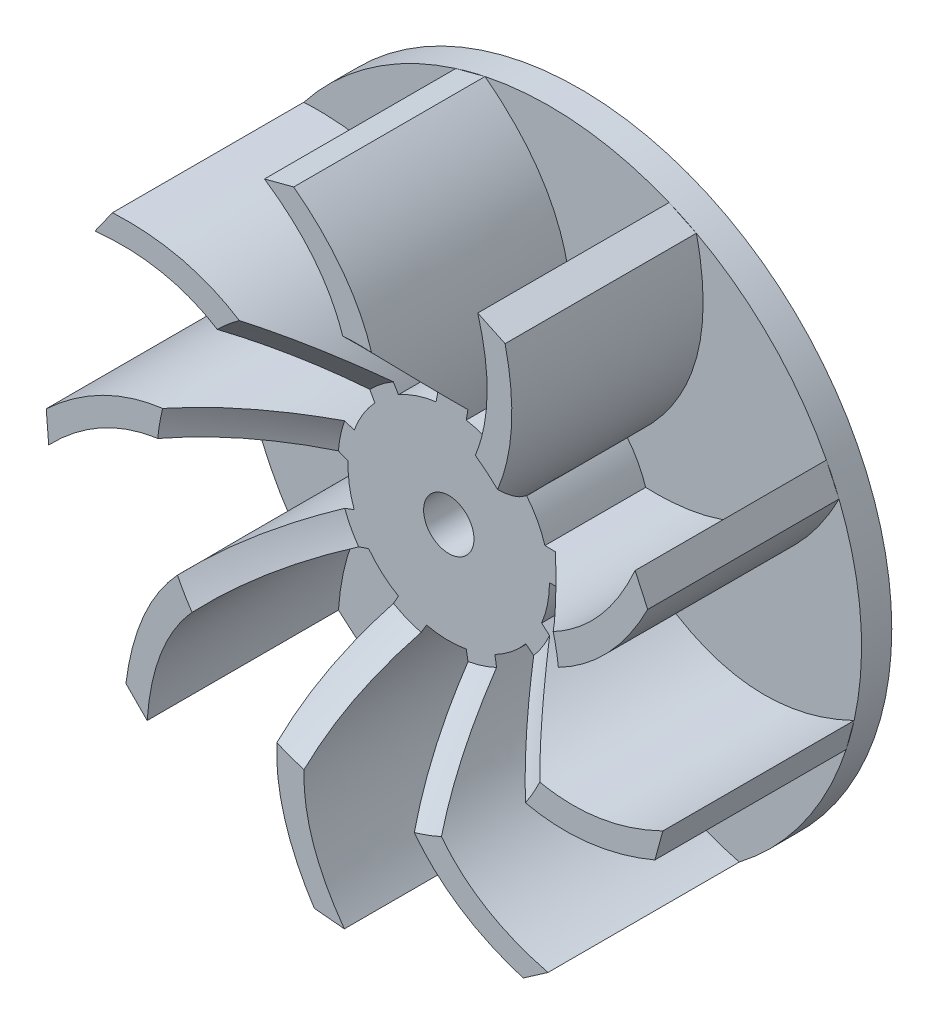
ISO-10303-21;
HEADER;
FILE_DESCRIPTION(('STEP AP214'),'2;1');
FILE_NAME('part.step','',(''),(''),'','','');
FILE_SCHEMA(('AUTOMOTIVE_DESIGN { 1 0 10303 214 1 1 1 1 }'));
ENDSEC;
DATA;
#1=APPLICATION_CONTEXT('core data for automotive mechanical design processes');
#2=APPLICATION_PROTOCOL_DEFINITION('international standard','automotive_design',2000,#1);
#3=PRODUCT_CONTEXT('',#1,'mechanical');
#4=PRODUCT('Part','Part','',(#3));
#5=PRODUCT_RELATED_PRODUCT_CATEGORY('part','',(#4));
#6=PRODUCT_DEFINITION_FORMATION('','',#4);
#7=PRODUCT_DEFINITION_CONTEXT('part definition',#1,'design');
#8=PRODUCT_DEFINITION('design','',#6,#7);
#9=PRODUCT_DEFINITION_SHAPE('','',#8);
#10=(LENGTH_UNIT() NAMED_UNIT(*) SI_UNIT(.MILLI.,.METRE.));
#11=(NAMED_UNIT(*) PLANE_ANGLE_UNIT() SI_UNIT($,.RADIAN.));
#12=(NAMED_UNIT(*) SI_UNIT($,.STERADIAN.) SOLID_ANGLE_UNIT());
#13=UNCERTAINTY_MEASURE_WITH_UNIT(LENGTH_MEASURE(1.E-05),#10,'distance_accuracy_value','');
#14=(GEOMETRIC_REPRESENTATION_CONTEXT(3) GLOBAL_UNCERTAINTY_ASSIGNED_CONTEXT((#13)) GLOBAL_UNIT_ASSIGNED_CONTEXT((#10,
#11,#12)) REPRESENTATION_CONTEXT('',''));
#15=CARTESIAN_POINT('',(0.,0.,0.));
#16=DIRECTION('',(0.,0.,1.));
#17=DIRECTION('',(1.,0.,0.));
#18=AXIS2_PLACEMENT_3D('',#15,#16,#17);
#19=CARTESIAN_POINT('',(0.,0.,22.));
#20=DIRECTION('',(0.,0.,-1.));
#21=DIRECTION('',(-1.,0.,0.));
#22=AXIS2_PLACEMENT_3D('',#19,#20,#21);
#23=CYLINDRICAL_SURFACE('',#22,10.);
#24=CARTESIAN_POINT('',(0.,0.,13.));
#25=DIRECTION('',(0.,0.,1.));
#26=DIRECTION('',(1.,0.,0.));
#27=AXIS2_PLACEMENT_3D('',#24,#25,#26);
#28=CIRCLE('',#27,10.);
#29=CARTESIAN_POINT('',(9.55,2.96605798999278,13.));
#30=VERTEX_POINT('',#29);
#31=CARTESIAN_POINT('',(7.66044443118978,6.4278760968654,13.));
#32=VERTEX_POINT('',#31);
#33=EDGE_CURVE('E1295',#30,#32,#28,.T.);
#34=ORIENTED_EDGE('',*,*,#33,.F.);
#35=DIRECTION('',(0.,0.,-1.));
#36=VECTOR('',#35,1.);
#37=CARTESIAN_POINT('',(9.55,2.96605798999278,22.));
#38=LINE('',#37,#36);
#39=CARTESIAN_POINT('',(9.55,2.96605798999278,3.));
#40=VERTEX_POINT('',#39);
#41=EDGE_CURVE('E96',#30,#40,#38,.T.);
#42=ORIENTED_EDGE('',*,*,#41,.T.);
#43=CARTESIAN_POINT('',(0.,0.,3.));
#44=DIRECTION('',(0.,0.,1.));
#45=DIRECTION('',(1.,0.,0.));
#46=AXIS2_PLACEMENT_3D('',#43,#44,#45);
#47=CIRCLE('',#46,10.);
#48=CARTESIAN_POINT('',(7.66044443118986,6.4278760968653,3.));
#49=VERTEX_POINT('',#48);
#50=EDGE_CURVE('E112',#40,#49,#47,.T.);
#51=ORIENTED_EDGE('',*,*,#50,.T.);
#52=DIRECTION('',(0.,0.,-1.));
#53=VECTOR('',#52,1.);
#54=CARTESIAN_POINT('',(7.66044443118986,6.4278760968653,22.));
#55=LINE('',#54,#53);
#56=EDGE_CURVE('E1372',#32,#49,#55,.T.);
#57=ORIENTED_EDGE('',*,*,#56,.F.);
#58=EDGE_LOOP('',(#34,#42,#51,#57));
#59=FACE_BOUND('',#58,.T.);
#60=ADVANCED_FACE('F37',(#59),#23,.T.);
#61=CARTESIAN_POINT('',(0.,0.,13.));
#62=DIRECTION('',(0.,0.,1.));
#63=DIRECTION('',(1.,0.,0.));
#64=AXIS2_PLACEMENT_3D('',#61,#62,#63);
#65=CIRCLE('',#64,10.);
#66=CARTESIAN_POINT('',(5.40917910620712,8.41075391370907,13.));
#67=VERTEX_POINT('',#66);
#68=CARTESIAN_POINT('',(1.7364817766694,9.84807753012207,13.));
#69=VERTEX_POINT('',#68);
#70=EDGE_CURVE('E356',#67,#69,#65,.T.);
#71=ORIENTED_EDGE('',*,*,#70,.F.);
#72=DIRECTION('',(0.,0.,-1.));
#73=VECTOR('',#72,1.);
#74=CARTESIAN_POINT('',(5.40917910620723,8.410753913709,22.));
#75=LINE('',#74,#73);
#76=CARTESIAN_POINT('',(5.40917910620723,8.410753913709,3.));
#77=VERTEX_POINT('',#76);
#78=EDGE_CURVE('E907',#67,#77,#75,.T.);
#79=ORIENTED_EDGE('',*,*,#78,.T.);
#80=CARTESIAN_POINT('',(1.7364817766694,9.84807753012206,3.));
#81=VERTEX_POINT('',#80);
#82=EDGE_CURVE('E151',#77,#81,#47,.T.);
#83=ORIENTED_EDGE('',*,*,#82,.T.);
#84=DIRECTION('',(0.,0.,-1.));
#85=VECTOR('',#84,1.);
#86=CARTESIAN_POINT('',(1.7364817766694,9.84807753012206,22.));
#87=LINE('',#86,#85);
#88=EDGE_CURVE('E905',#69,#81,#87,.T.);
#89=ORIENTED_EDGE('',*,*,#88,.F.);
#90=EDGE_LOOP('',(#71,#79,#83,#89));
#91=FACE_BOUND('',#90,.T.);
#92=ADVANCED_FACE('F416',(#91),#23,.T.);
#93=CARTESIAN_POINT('',(0.,0.,13.));
#94=DIRECTION('',(0.,0.,1.));
#95=DIRECTION('',(1.,0.,0.));
#96=AXIS2_PLACEMENT_3D('',#93,#94,#95);
#97=CIRCLE('',#96,10.);
#98=CARTESIAN_POINT('',(-1.26265680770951,9.91996460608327,13.));
#99=VERTEX_POINT('',#98);
#100=CARTESIAN_POINT('',(-4.99999999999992,8.66025403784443,13.));
#101=VERTEX_POINT('',#100);
#102=EDGE_CURVE('E1280',#99,#101,#97,.T.);
#103=ORIENTED_EDGE('',*,*,#102,.F.);
#104=DIRECTION('',(0.,0.,-1.));
#105=VECTOR('',#104,1.);
#106=CARTESIAN_POINT('',(-1.26265680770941,9.91996460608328,22.));
#107=LINE('',#106,#105);
#108=CARTESIAN_POINT('',(-1.26265680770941,9.91996460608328,3.));
#109=VERTEX_POINT('',#108);
#110=EDGE_CURVE('E947',#99,#109,#107,.T.);
#111=ORIENTED_EDGE('',*,*,#110,.T.);
#112=CARTESIAN_POINT('',(-4.99999999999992,8.66025403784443,3.));
#113=VERTEX_POINT('',#112);
#114=EDGE_CURVE('E891',#109,#113,#47,.T.);
#115=ORIENTED_EDGE('',*,*,#114,.T.);
#116=DIRECTION('',(0.,0.,-1.));
#117=VECTOR('',#116,1.);
#118=CARTESIAN_POINT('',(-4.99999999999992,8.66025403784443,22.));
#119=LINE('',#118,#117);
#120=EDGE_CURVE('E1400',#101,#113,#119,.T.);
#121=ORIENTED_EDGE('',*,*,#120,.F.);
#122=EDGE_LOOP('',(#103,#111,#115,#121));
#123=FACE_BOUND('',#122,.T.);
#124=ADVANCED_FACE('F421',(#123),#23,.T.);
#125=CARTESIAN_POINT('',(0.,0.,13.));
#126=DIRECTION('',(0.,0.,1.));
#127=DIRECTION('',(1.,0.,0.));
#128=AXIS2_PLACEMENT_3D('',#125,#126,#127);
#129=CIRCLE('',#128,10.);
#130=CARTESIAN_POINT('',(-7.34368156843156,6.787513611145,13.));
#131=VERTEX_POINT('',#130);
#132=CARTESIAN_POINT('',(-9.39692620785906,3.42020143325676,13.));
#133=VERTEX_POINT('',#132);
#134=EDGE_CURVE('E1264',#131,#133,#129,.T.);
#135=ORIENTED_EDGE('',*,*,#134,.F.);
#136=DIRECTION('',(0.,0.,-1.));
#137=VECTOR('',#136,1.);
#138=CARTESIAN_POINT('',(-7.34368156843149,6.78751361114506,22.));
#139=LINE('',#138,#137);
#140=CARTESIAN_POINT('',(-7.34368156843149,6.78751361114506,3.));
#141=VERTEX_POINT('',#140);
#142=EDGE_CURVE('E1421',#131,#141,#139,.T.);
#143=ORIENTED_EDGE('',*,*,#142,.T.);
#144=CARTESIAN_POINT('',(-9.39692620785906,3.42020143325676,3.));
#145=VERTEX_POINT('',#144);
#146=EDGE_CURVE('E886',#141,#145,#47,.T.);
#147=ORIENTED_EDGE('',*,*,#146,.T.);
#148=DIRECTION('',(0.,0.,-1.));
#149=VECTOR('',#148,1.);
#150=CARTESIAN_POINT('',(-9.39692620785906,3.42020143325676,22.));
#151=LINE('',#150,#149);
#152=EDGE_CURVE('E986',#133,#145,#151,.T.);
#153=ORIENTED_EDGE('',*,*,#152,.F.);
#154=EDGE_LOOP('',(#135,#143,#147,#153));
#155=FACE_BOUND('',#154,.T.);
#156=ADVANCED_FACE('F1773',(#155),#23,.T.);
#157=CARTESIAN_POINT('',(0.,0.,13.));
#158=DIRECTION('',(0.,0.,1.));
#159=DIRECTION('',(1.,0.,0.));
#160=AXIS2_PLACEMENT_3D('',#157,#158,#159);
#161=CIRCLE('',#160,10.);
#162=CARTESIAN_POINT('',(-9.988516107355,0.479109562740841,13.));
#163=VERTEX_POINT('',#162);
#164=CARTESIAN_POINT('',(-9.3969262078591,-3.42020143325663,13.));
#165=VERTEX_POINT('',#164);
#166=EDGE_CURVE('E1248',#163,#165,#161,.T.);
#167=ORIENTED_EDGE('',*,*,#166,.F.);
#168=DIRECTION('',(0.,0.,-1.));
#169=VECTOR('',#168,1.);
#170=CARTESIAN_POINT('',(-9.988516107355,0.479109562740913,22.));
#171=LINE('',#170,#169);
#172=CARTESIAN_POINT('',(-9.988516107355,0.479109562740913,3.));
#173=VERTEX_POINT('',#172);
#174=EDGE_CURVE('E1013',#163,#173,#171,.T.);
#175=ORIENTED_EDGE('',*,*,#174,.T.);
#176=CARTESIAN_POINT('',(-9.39692620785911,-3.42020143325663,3.));
#177=VERTEX_POINT('',#176);
#178=EDGE_CURVE('E880',#173,#177,#47,.T.);
#179=ORIENTED_EDGE('',*,*,#178,.T.);
#180=DIRECTION('',(0.,0.,-1.));
#181=VECTOR('',#180,1.);
#182=CARTESIAN_POINT('',(-9.39692620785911,-3.42020143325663,22.));
#183=LINE('',#182,#181);
#184=EDGE_CURVE('E1113',#165,#177,#183,.T.);
#185=ORIENTED_EDGE('',*,*,#184,.F.);
#186=EDGE_LOOP('',(#167,#175,#179,#185));
#187=FACE_BOUND('',#186,.T.);
#188=ADVANCED_FACE('F1765',(#187),#23,.T.);
#189=CARTESIAN_POINT('',(0.,0.,13.));
#190=DIRECTION('',(0.,0.,1.));
#191=DIRECTION('',(1.,0.,0.));
#192=AXIS2_PLACEMENT_3D('',#189,#190,#191);
#193=CIRCLE('',#192,10.);
#194=CARTESIAN_POINT('',(-7.95961294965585,-6.05347517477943,13.));
#195=VERTEX_POINT('',#194);
#196=CARTESIAN_POINT('',(-5.00000000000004,-8.66025403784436,13.));
#197=VERTEX_POINT('',#196);
#198=EDGE_CURVE('E1232',#195,#197,#193,.T.);
#199=ORIENTED_EDGE('',*,*,#198,.F.);
#200=DIRECTION('',(0.,0.,-1.));
#201=VECTOR('',#200,1.);
#202=CARTESIAN_POINT('',(-7.95961294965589,-6.05347517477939,22.));
#203=LINE('',#202,#201);
#204=CARTESIAN_POINT('',(-7.95961294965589,-6.05347517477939,3.));
#205=VERTEX_POINT('',#204);
#206=EDGE_CURVE('E1118',#195,#205,#203,.T.);
#207=ORIENTED_EDGE('',*,*,#206,.T.);
#208=CARTESIAN_POINT('',(-5.00000000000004,-8.66025403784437,3.));
#209=VERTEX_POINT('',#208);
#210=EDGE_CURVE('E878',#205,#209,#47,.T.);
#211=ORIENTED_EDGE('',*,*,#210,.T.);
#212=DIRECTION('',(0.,0.,-1.));
#213=VECTOR('',#212,1.);
#214=CARTESIAN_POINT('',(-5.00000000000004,-8.66025403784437,22.));
#215=LINE('',#214,#213);
#216=EDGE_CURVE('E1052',#197,#209,#215,.T.);
#217=ORIENTED_EDGE('',*,*,#216,.F.);
#218=EDGE_LOOP('',(#199,#207,#211,#217));
#219=FACE_BOUND('',#218,.T.);
#220=ADVANCED_FACE('F436',(#219),#23,.T.);
#221=CARTESIAN_POINT('',(0.,0.,13.));
#222=DIRECTION('',(0.,0.,1.));
#223=DIRECTION('',(1.,0.,0.));
#224=AXIS2_PLACEMENT_3D('',#221,#222,#223);
#225=CIRCLE('',#224,10.);
#226=CARTESIAN_POINT('',(-2.20631843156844,-9.75357160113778,13.));
#227=VERTEX_POINT('',#226);
#228=CARTESIAN_POINT('',(1.73648177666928,-9.84807753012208,13.));
#229=VERTEX_POINT('',#228);
#230=EDGE_CURVE('E1217',#227,#229,#225,.T.);
#231=ORIENTED_EDGE('',*,*,#230,.F.);
#232=DIRECTION('',(0.,0.,-1.));
#233=VECTOR('',#232,1.);
#234=CARTESIAN_POINT('',(-2.20631843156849,-9.75357160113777,22.));
#235=LINE('',#234,#233);
#236=CARTESIAN_POINT('',(-2.20631843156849,-9.75357160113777,3.));
#237=VERTEX_POINT('',#236);
#238=EDGE_CURVE('E1076',#227,#237,#235,.T.);
#239=ORIENTED_EDGE('',*,*,#238,.T.);
#240=CARTESIAN_POINT('',(1.73648177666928,-9.84807753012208,3.));
#241=VERTEX_POINT('',#240);
#242=EDGE_CURVE('E636',#237,#241,#47,.T.);
#243=ORIENTED_EDGE('',*,*,#242,.T.);
#244=DIRECTION('',(0.,0.,-1.));
#245=VECTOR('',#244,1.);
#246=CARTESIAN_POINT('',(1.73648177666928,-9.84807753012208,22.));
#247=LINE('',#246,#245);
#248=EDGE_CURVE('E469',#229,#241,#247,.T.);
#249=ORIENTED_EDGE('',*,*,#248,.F.);
#250=EDGE_LOOP('',(#231,#239,#243,#249));
#251=FACE_BOUND('',#250,.T.);
#252=ADVANCED_FACE('F431',(#251),#23,.T.);
#253=CARTESIAN_POINT('',(0.,0.,13.));
#254=DIRECTION('',(0.,0.,1.));
#255=DIRECTION('',(1.,0.,0.));
#256=AXIS2_PLACEMENT_3D('',#253,#254,#255);
#257=CIRCLE('',#256,10.);
#258=CARTESIAN_POINT('',(4.57933700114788,-8.8898634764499,13.));
#259=VERTEX_POINT('',#258);
#260=CARTESIAN_POINT('',(7.66044443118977,-6.4278760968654,13.));
#261=VERTEX_POINT('',#260);
#262=EDGE_CURVE('E443',#259,#261,#257,.T.);
#263=ORIENTED_EDGE('',*,*,#262,.F.);
#264=DIRECTION('',(0.,0.,-1.));
#265=VECTOR('',#264,1.);
#266=CARTESIAN_POINT('',(4.57933700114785,-8.88986347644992,22.));
#267=LINE('',#266,#265);
#268=CARTESIAN_POINT('',(4.57933700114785,-8.88986347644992,3.));
#269=VERTEX_POINT('',#268);
#270=EDGE_CURVE('E447',#259,#269,#267,.T.);
#271=ORIENTED_EDGE('',*,*,#270,.T.);
#272=CARTESIAN_POINT('',(7.66044443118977,-6.42787609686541,3.));
#273=VERTEX_POINT('',#272);
#274=EDGE_CURVE('E109',#269,#273,#47,.T.);
#275=ORIENTED_EDGE('',*,*,#274,.T.);
#276=DIRECTION('',(0.,0.,-1.));
#277=VECTOR('',#276,1.);
#278=CARTESIAN_POINT('',(7.66044443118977,-6.42787609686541,22.));
#279=LINE('',#278,#277);
#280=EDGE_CURVE('E451',#261,#273,#279,.T.);
#281=ORIENTED_EDGE('',*,*,#280,.F.);
#282=EDGE_LOOP('',(#263,#271,#275,#281));
#283=FACE_BOUND('',#282,.T.);
#284=ADVANCED_FACE('F425',(#283),#23,.T.);
#285=CARTESIAN_POINT('',(0.,0.,13.));
#286=DIRECTION('',(0.,0.,1.));
#287=DIRECTION('',(1.,0.,0.));
#288=AXIS2_PLACEMENT_3D('',#285,#286,#287);
#289=CIRCLE('',#288,10.);
#290=CARTESIAN_POINT('',(9.22226975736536,-3.86648943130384,13.));
#291=VERTEX_POINT('',#290);
#292=CARTESIAN_POINT('',(10.,0.,13.));
#293=VERTEX_POINT('',#292);
#294=EDGE_CURVE('E1186',#291,#293,#289,.T.);
#295=ORIENTED_EDGE('',*,*,#294,.F.);
#296=DIRECTION('',(0.,0.,-1.));
#297=VECTOR('',#296,1.);
#298=CARTESIAN_POINT('',(9.22226975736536,-3.86648943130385,22.));
#299=LINE('',#298,#297);
#300=CARTESIAN_POINT('',(9.22226975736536,-3.86648943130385,3.));
#301=VERTEX_POINT('',#300);
#302=EDGE_CURVE('E105',#291,#301,#299,.T.);
#303=ORIENTED_EDGE('',*,*,#302,.T.);
#304=CARTESIAN_POINT('',(10.,0.,3.));
#305=VERTEX_POINT('',#304);
#306=EDGE_CURVE('E101',#301,#305,#47,.T.);
#307=ORIENTED_EDGE('',*,*,#306,.T.);
#308=DIRECTION('',(0.,0.,-1.));
#309=VECTOR('',#308,1.);
#310=CARTESIAN_POINT('',(10.,0.,22.));
#311=LINE('',#310,#309);
#312=EDGE_CURVE('E82',#293,#305,#311,.T.);
#313=ORIENTED_EDGE('',*,*,#312,.F.);
#314=EDGE_LOOP('',(#295,#303,#307,#313));
#315=FACE_BOUND('',#314,.T.);
#316=ADVANCED_FACE('F102',(#315),#23,.T.);
#317=CARTESIAN_POINT('',(0.,0.,22.));
#318=DIRECTION('',(0.,0.,1.));
#319=DIRECTION('',(1.,0.,0.));
#320=AXIS2_PLACEMENT_3D('',#317,#318,#319);
#321=PLANE('',#320);
#322=CARTESIAN_POINT('',(0.,0.,22.));
#323=DIRECTION('',(0.,0.,1.));
#324=DIRECTION('',(1.,0.,0.));
#325=AXIS2_PLACEMENT_3D('',#322,#323,#324);
#326=CIRCLE('',#325,20.);
#327=CARTESIAN_POINT('',(19.8835401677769,2.15518685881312,22.));
#328=VERTEX_POINT('',#327);
#329=CARTESIAN_POINT('',(19.369814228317,4.98099355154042,22.));
#330=VERTEX_POINT('',#329);
#331=EDGE_CURVE('E335',#328,#330,#326,.T.);
#332=ORIENTED_EDGE('',*,*,#331,.F.);
#333=CARTESIAN_POINT('',(10.,0.,22.));
#334=CARTESIAN_POINT('',(22.7510366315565,-0.13914535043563,22.));
#335=CARTESIAN_POINT('',(28.7592454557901,11.5717674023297,22.));
#336=B_SPLINE_CURVE_WITH_KNOTS('',2,(#333,#334,#335),.UNSPECIFIED.,.F.,.F.,(3,3),(0.,1.),.UNSPECIFIED.);
#337=CARTESIAN_POINT('',(28.75924545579,11.5717674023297,22.));
#338=VERTEX_POINT('',#337);
#339=EDGE_CURVE('E139',#328,#338,#336,.T.);
#340=ORIENTED_EDGE('',*,*,#339,.T.);
#341=DIRECTION('',(-0.417735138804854,0.908568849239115,0.));
#342=VECTOR('',#341,1.);
#343=CARTESIAN_POINT('',(28.75924545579,11.5717674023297,22.));
#344=LINE('',#343,#342);
#345=CARTESIAN_POINT('',(27.5060400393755,14.297473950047,22.));
#346=VERTEX_POINT('',#345);
#347=EDGE_CURVE('E62',#338,#346,#344,.T.);
#348=ORIENTED_EDGE('',*,*,#347,.T.);
#349=CARTESIAN_POINT('',(27.5060400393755,14.297473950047,22.));
#350=CARTESIAN_POINT('',(22.2551592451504,2.51503739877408,22.));
#351=CARTESIAN_POINT('',(9.55,2.96605798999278,22.));
#352=B_SPLINE_CURVE_WITH_KNOTS('',2,(#349,#350,#351),.UNSPECIFIED.,.F.,.F.,(3,3),(0.,1.),.UNSPECIFIED.);
#353=EDGE_CURVE('E97',#346,#330,#352,.T.);
#354=ORIENTED_EDGE('',*,*,#353,.T.);
#355=EDGE_LOOP('',(#332,#340,#348,#354));
#356=FACE_BOUND('',#355,.T.);
#357=ADVANCED_FACE('F332',(#356),#321,.T.);
#358=CARTESIAN_POINT('',(13.8463480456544,14.4318621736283,22.));
#359=VERTEX_POINT('',#358);
#360=CARTESIAN_POINT('',(11.6364176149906,16.2663390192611,22.));
#361=VERTEX_POINT('',#360);
#362=EDGE_CURVE('E373',#359,#361,#326,.T.);
#363=ORIENTED_EDGE('',*,*,#362,.F.);
#364=CARTESIAN_POINT('',(7.66044443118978,6.4278760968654,22.));
#365=CARTESIAN_POINT('',(17.5177460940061,14.5174929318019,22.));
#366=CARTESIAN_POINT('',(14.5926714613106,27.3505747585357,22.));
#367=B_SPLINE_CURVE_WITH_KNOTS('',2,(#364,#365,#366),.UNSPECIFIED.,.F.,.F.,(3,3),(0.,1.),.UNSPECIFIED.);
#368=CARTESIAN_POINT('',(14.5926714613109,27.3505747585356,22.));
#369=VERTEX_POINT('',#368);
#370=EDGE_CURVE('E1371',#359,#369,#367,.T.);
#371=ORIENTED_EDGE('',*,*,#370,.T.);
#372=DIRECTION('',(-0.904020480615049,0.427489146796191,0.));
#373=VECTOR('',#372,1.);
#374=CARTESIAN_POINT('',(14.5926714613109,27.3505747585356,22.));
#375=LINE('',#374,#373);
#376=CARTESIAN_POINT('',(11.8806100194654,28.6330421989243,22.));
#377=VERTEX_POINT('',#376);
#378=EDGE_CURVE('E1485',#369,#377,#375,.T.);
#379=ORIENTED_EDGE('',*,*,#378,.T.);
#380=CARTESIAN_POINT('',(11.8806100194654,28.6330421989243,22.));
#381=CARTESIAN_POINT('',(15.4318061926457,16.2319710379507,22.));
#382=CARTESIAN_POINT('',(5.40917910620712,8.41075391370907,22.));
#383=B_SPLINE_CURVE_WITH_KNOTS('',2,(#380,#381,#382),.UNSPECIFIED.,.F.,.F.,(3,3),(0.,1.),.UNSPECIFIED.);
#384=EDGE_CURVE('E1359',#377,#361,#383,.T.);
#385=ORIENTED_EDGE('',*,*,#384,.T.);
#386=EDGE_LOOP('',(#363,#371,#379,#385));
#387=FACE_BOUND('',#386,.T.);
#388=ADVANCED_FACE('F430',(#387),#321,.T.);
#389=CARTESIAN_POINT('',(1.3302957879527,19.955708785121,22.));
#390=VERTEX_POINT('',#389);
#391=CARTESIAN_POINT('',(-1.54178812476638,19.9404836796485,22.));
#392=VERTEX_POINT('',#391);
#393=EDGE_CURVE('E376',#390,#392,#326,.T.);
#394=ORIENTED_EDGE('',*,*,#393,.F.);
#395=CARTESIAN_POINT('',(1.7364817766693,9.84807753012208,22.));
#396=CARTESIAN_POINT('',(4.08770747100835,22.3812349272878,22.));
#397=CARTESIAN_POINT('',(-6.40197568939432,30.3317442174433,22.));
#398=B_SPLINE_CURVE_WITH_KNOTS('',2,(#395,#396,#397),.UNSPECIFIED.,.F.,.F.,(3,3),(0.,1.),.UNSPECIFIED.);
#399=CARTESIAN_POINT('',(-6.40197568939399,30.3317442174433,22.));
#400=VERTEX_POINT('',#399);
#401=EDGE_CURVE('E942',#390,#400,#398,.T.);
#402=ORIENTED_EDGE('',*,*,#401,.T.);
#403=DIRECTION('',(-0.967304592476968,-0.25361747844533,0.));
#404=VECTOR('',#403,1.);
#405=CARTESIAN_POINT('',(-6.40197568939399,30.3317442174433,22.));
#406=LINE('',#405,#404);
#407=CARTESIAN_POINT('',(-9.30388946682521,29.5708917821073,22.));
#408=VERTEX_POINT('',#407);
#409=EDGE_CURVE('E1383',#400,#408,#406,.T.);
#410=ORIENTED_EDGE('',*,*,#409,.T.);
#411=CARTESIAN_POINT('',(-9.30388946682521,29.5708917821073,22.));
#412=CARTESIAN_POINT('',(1.38773951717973,22.3537850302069,22.));
#413=CARTESIAN_POINT('',(-1.26265680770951,9.91996460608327,22.));
#414=B_SPLINE_CURVE_WITH_KNOTS('',2,(#411,#412,#413),.UNSPECIFIED.,.F.,.F.,(3,3),(0.,1.),.UNSPECIFIED.);
#415=EDGE_CURVE('E929',#408,#392,#414,.T.);
#416=ORIENTED_EDGE('',*,*,#415,.T.);
#417=EDGE_LOOP('',(#394,#402,#410,#416));
#418=FACE_BOUND('',#417,.T.);
#419=ADVANCED_FACE('F1467',(#418),#321,.T.);
#420=CARTESIAN_POINT('',(-11.8082166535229,16.1420574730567,22.));
#421=VERTEX_POINT('',#420);
#422=CARTESIAN_POINT('',(-13.9985740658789,14.2842544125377,22.));
#423=VERTEX_POINT('',#422);
#424=EDGE_CURVE('E1461',#421,#423,#326,.T.);
#425=ORIENTED_EDGE('',*,*,#424,.F.);
#426=CARTESIAN_POINT('',(-5.,8.66025403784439,22.));
#427=CARTESIAN_POINT('',(-11.2550149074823,19.7725483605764,22.));
#428=CARTESIAN_POINT('',(-24.4010672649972,19.1203534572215,22.));
#429=B_SPLINE_CURVE_WITH_KNOTS('',2,(#426,#427,#428),.UNSPECIFIED.,.F.,.F.,(3,3),(0.,1.),.UNSPECIFIED.);
#430=CARTESIAN_POINT('',(-24.401067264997,19.1203534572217,22.));
#431=VERTEX_POINT('',#430);
#432=EDGE_CURVE('E955',#421,#431,#429,.T.);
#433=ORIENTED_EDGE('',*,*,#432,.T.);
#434=DIRECTION('',(-0.577976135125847,-0.816053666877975,0.));
#435=VECTOR('',#434,1.);
#436=CARTESIAN_POINT('',(-24.401067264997,19.1203534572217,22.));
#437=LINE('',#436,#435);
#438=CARTESIAN_POINT('',(-26.1349956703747,16.6721924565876,22.));
#439=VERTEX_POINT('',#438);
#440=EDGE_CURVE('E960',#431,#439,#437,.T.);
#441=ORIENTED_EDGE('',*,*,#440,.T.);
#442=CARTESIAN_POINT('',(-26.1349956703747,16.6721924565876,22.));
#443=CARTESIAN_POINT('',(-13.3056659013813,18.0160145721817,22.));
#444=CARTESIAN_POINT('',(-7.34368156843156,6.787513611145,22.));
#445=B_SPLINE_CURVE_WITH_KNOTS('',2,(#442,#443,#444),.UNSPECIFIED.,.F.,.F.,(3,3),(0.,1.),.UNSPECIFIED.);
#446=EDGE_CURVE('E1395',#439,#423,#445,.T.);
#447=ORIENTED_EDGE('',*,*,#446,.T.);
#448=EDGE_LOOP('',(#425,#433,#441,#447));
#449=FACE_BOUND('',#448,.T.);
#450=ADVANCED_FACE('F1705',(#449),#321,.T.);
#451=CARTESIAN_POINT('',(-19.421533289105,4.77535807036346,22.));
#452=VERTEX_POINT('',#451);
#453=CARTESIAN_POINT('',(-19.9052716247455,1.94426375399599,22.));
#454=VERTEX_POINT('',#453);
#455=EDGE_CURVE('E1460',#452,#454,#326,.T.);
#456=ORIENTED_EDGE('',*,*,#455,.F.);
#457=CARTESIAN_POINT('',(-9.39692620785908,3.42020143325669,22.));
#458=CARTESIAN_POINT('',(-21.3313907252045,7.91206666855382,22.));
#459=CARTESIAN_POINT('',(-30.9826282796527,-1.03766318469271,22.));
#460=B_SPLINE_CURVE_WITH_KNOTS('',2,(#457,#458,#459),.UNSPECIFIED.,.F.,.F.,(3,3),(0.,1.),.UNSPECIFIED.);
#461=CARTESIAN_POINT('',(-30.9826282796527,-1.03766318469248,22.));
#462=VERTEX_POINT('',#461);
#463=EDGE_CURVE('E1008',#452,#462,#460,.T.);
#464=ORIENTED_EDGE('',*,*,#463,.T.);
#465=DIRECTION('',(0.0817937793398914,-0.996649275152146,0.));
#466=VECTOR('',#465,1.);
#467=CARTESIAN_POINT('',(-30.9826282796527,-1.03766318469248,22.));
#468=LINE('',#467,#466);
#469=CARTESIAN_POINT('',(-30.737246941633,-4.02761101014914,22.));
#470=VERTEX_POINT('',#469);
#471=EDGE_CURVE('E987',#462,#470,#468,.T.);
#472=ORIENTED_EDGE('',*,*,#471,.T.);
#473=CARTESIAN_POINT('',(-30.737246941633,-4.02761101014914,22.));
#474=CARTESIAN_POINT('',(-21.7732023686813,5.24835067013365,22.));
#475=CARTESIAN_POINT('',(-9.988516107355,0.479109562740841,22.));
#476=B_SPLINE_CURVE_WITH_KNOTS('',2,(#473,#474,#475),.UNSPECIFIED.,.F.,.F.,(3,3),(0.,1.),.UNSPECIFIED.);
#477=EDGE_CURVE('E979',#470,#454,#476,.T.);
#478=ORIENTED_EDGE('',*,*,#477,.T.);
#479=EDGE_LOOP('',(#456,#464,#472,#478));
#480=FACE_BOUND('',#479,.T.);
#481=ADVANCED_FACE('F1695',(#480),#321,.T.);
#482=CARTESIAN_POINT('',(-17.9472986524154,-8.8257844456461,22.));
#483=VERTEX_POINT('',#482);
#484=CARTESIAN_POINT('',(-16.4980713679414,-11.3054695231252,22.));
#485=VERTEX_POINT('',#484);
#486=EDGE_CURVE('E1458',#483,#485,#326,.T.);
#487=ORIENTED_EDGE('',*,*,#486,.F.);
#488=CARTESIAN_POINT('',(-9.39692620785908,-3.42020143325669,22.));
#489=CARTESIAN_POINT('',(-21.4265717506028,-7.65055895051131,22.));
#490=CARTESIAN_POINT('',(-23.0670731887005,-20.7101456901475,22.));
#491=B_SPLINE_CURVE_WITH_KNOTS('',2,(#488,#489,#490),.UNSPECIFIED.,.F.,.F.,(3,3),(0.,1.),.UNSPECIFIED.);
#492=CARTESIAN_POINT('',(-23.0670731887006,-20.7101456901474,22.));
#493=VERTEX_POINT('',#492);
#494=EDGE_CURVE('E1022',#483,#493,#491,.T.);
#495=ORIENTED_EDGE('',*,*,#494,.T.);
#496=DIRECTION('',(0.703291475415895,-0.71090161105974,0.));
#497=VECTOR('',#496,1.);
#498=CARTESIAN_POINT('',(-23.0670731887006,-20.7101456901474,22.));
#499=LINE('',#498,#497);
#500=CARTESIAN_POINT('',(-20.9571987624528,-22.8428505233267,22.));
#501=VERTEX_POINT('',#500);
#502=EDGE_CURVE('E1027',#493,#501,#499,.T.);
#503=ORIENTED_EDGE('',*,*,#502,.T.);
#504=CARTESIAN_POINT('',(-20.9571987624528,-22.8428505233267,22.));
#505=CARTESIAN_POINT('',(-20.0528154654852,-9.97507483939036,22.));
#506=CARTESIAN_POINT('',(-7.95961294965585,-6.05347517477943,22.));
#507=B_SPLINE_CURVE_WITH_KNOTS('',2,(#504,#505,#506),.UNSPECIFIED.,.F.,.F.,(3,3),(0.,1.),.UNSPECIFIED.);
#508=EDGE_CURVE('E1119',#501,#485,#507,.T.);
#509=ORIENTED_EDGE('',*,*,#508,.T.);
#510=EDGE_LOOP('',(#487,#495,#503,#509));
#511=FACE_BOUND('',#510,.T.);
#512=ADVANCED_FACE('F1457',(#511),#321,.T.);
#513=CARTESIAN_POINT('',(-8.07532351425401,-18.2972443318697,22.));
#514=VERTEX_POINT('',#513);
#515=CARTESIAN_POINT('',(-5.37124016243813,-19.265247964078,22.));
#516=VERTEX_POINT('',#515);
#517=EDGE_CURVE('E388',#514,#516,#326,.T.);
#518=ORIENTED_EDGE('',*,*,#517,.F.);
#519=CARTESIAN_POINT('',(-5.,-8.66025403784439,22.));
#520=CARTESIAN_POINT('',(-11.4960217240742,-19.6334030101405,22.));
#521=CARTESIAN_POINT('',(-4.35817819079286,-30.6921208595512,22.));
#522=B_SPLINE_CURVE_WITH_KNOTS('',2,(#519,#520,#521),.UNSPECIFIED.,.F.,.F.,(3,3),(0.,1.),.UNSPECIFIED.);
#523=CARTESIAN_POINT('',(-4.35817819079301,-30.6921208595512,22.));
#524=VERTEX_POINT('',#523);
#525=EDGE_CURVE('E1071',#514,#524,#522,.T.);
#526=ORIENTED_EDGE('',*,*,#525,.T.);
#527=DIRECTION('',(0.995711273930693,-0.0925151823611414,0.));
#528=VECTOR('',#527,1.);
#529=CARTESIAN_POINT('',(-4.35817819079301,-30.6921208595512,22.));
#530=LINE('',#529,#528);
#531=CARTESIAN_POINT('',(-1.37104436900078,-30.9696664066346,22.));
#532=VERTEX_POINT('',#531);
#533=EDGE_CURVE('E1053',#524,#532,#530,.T.);
#534=ORIENTED_EDGE('',*,*,#533,.T.);
#535=CARTESIAN_POINT('',(-1.37104436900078,-30.9696664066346,22.));
#536=CARTESIAN_POINT('',(-8.94949334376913,-20.5310519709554,22.));
#537=CARTESIAN_POINT('',(-2.20631843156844,-9.75357160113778,22.));
#538=B_SPLINE_CURVE_WITH_KNOTS('',2,(#535,#536,#537),.UNSPECIFIED.,.F.,.F.,(3,3),(0.,1.),.UNSPECIFIED.);
#539=EDGE_CURVE('E1045',#532,#516,#538,.T.);
#540=ORIENTED_EDGE('',*,*,#539,.T.);
#541=EDGE_LOOP('',(#518,#526,#534,#540));
#542=FACE_BOUND('',#541,.T.);
#543=ADVANCED_FACE('F1131',(#542),#321,.T.);
#544=CARTESIAN_POINT('',(5.57518524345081,-19.2072202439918,22.));
#545=VERTEX_POINT('',#544);
#546=CARTESIAN_POINT('',(8.26885400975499,-18.2106027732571,22.));
#547=VERTEX_POINT('',#546);
#548=EDGE_CURVE('E379',#545,#547,#326,.T.);
#549=ORIENTED_EDGE('',*,*,#548,.F.);
#550=CARTESIAN_POINT('',(1.7364817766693,-9.84807753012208,22.));
#551=CARTESIAN_POINT('',(3.81364463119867,-22.4295596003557,22.));
#552=CARTESIAN_POINT('',(16.3899568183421,-26.312911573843,22.));
#553=B_SPLINE_CURVE_WITH_KNOTS('',2,(#550,#551,#552),.UNSPECIFIED.,.F.,.F.,(3,3),(0.,1.),.UNSPECIFIED.);
#554=CARTESIAN_POINT('',(16.389956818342,-26.3129115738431,22.));
#555=VERTEX_POINT('',#554);
#556=EDGE_CURVE('E638',#545,#555,#553,.T.);
#557=ORIENTED_EDGE('',*,*,#556,.T.);
#558=DIRECTION('',(0.822226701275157,0.569160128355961,0.));
#559=VECTOR('',#558,1.);
#560=CARTESIAN_POINT('',(16.389956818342,-26.3129115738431,22.));
#561=LINE('',#560,#559);
#562=CARTESIAN_POINT('',(18.8566369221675,-24.6054311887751,22.));
#563=VERTEX_POINT('',#562);
#564=EDGE_CURVE('E640',#555,#563,#561,.T.);
#565=ORIENTED_EDGE('',*,*,#564,.T.);
#566=CARTESIAN_POINT('',(18.8566369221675,-24.6054311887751,22.));
#567=CARTESIAN_POINT('',(6.34139617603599,-21.4803217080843,22.));
#568=CARTESIAN_POINT('',(4.57933700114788,-8.8898634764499,22.));
#569=B_SPLINE_CURVE_WITH_KNOTS('',2,(#566,#567,#568),.UNSPECIFIED.,.F.,.F.,(3,3),(0.,1.),.UNSPECIFIED.);
#570=EDGE_CURVE('E474',#563,#547,#569,.T.);
#571=ORIENTED_EDGE('',*,*,#570,.T.);
#572=EDGE_LOOP('',(#549,#557,#565,#571));
#573=FACE_BOUND('',#572,.T.);
#574=ADVANCED_FACE('F687',(#573),#321,.T.);
#575=CARTESIAN_POINT('',(0.,0.,3.));
#576=DIRECTION('',(0.,0.,1.));
#577=DIRECTION('',(1.,0.,0.));
#578=AXIS2_PLACEMENT_3D('',#575,#576,#577);
#579=PLANE('',#578);
#580=CARTESIAN_POINT('',(0.,0.,3.));
#581=DIRECTION('',(0.,0.,1.));
#582=DIRECTION('',(1.,0.,0.));
#583=AXIS2_PLACEMENT_3D('',#580,#581,#582);
#584=CIRCLE('',#583,31.);
#585=CARTESIAN_POINT('',(27.5060400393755,14.297473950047,3.));
#586=VERTEX_POINT('',#585);
#587=CARTESIAN_POINT('',(14.5926714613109,27.3505747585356,3.));
#588=VERTEX_POINT('',#587);
#589=EDGE_CURVE('E155',#586,#588,#584,.T.);
#590=ORIENTED_EDGE('',*,*,#589,.T.);
#591=CARTESIAN_POINT('',(7.66044443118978,6.4278760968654,3.));
#592=CARTESIAN_POINT('',(17.5177460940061,14.5174929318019,3.));
#593=CARTESIAN_POINT('',(14.5926714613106,27.3505747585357,3.));
#594=B_SPLINE_CURVE_WITH_KNOTS('',2,(#591,#592,#593),.UNSPECIFIED.,.F.,.F.,(3,3),(0.,1.),.UNSPECIFIED.);
#595=EDGE_CURVE('E1350',#49,#588,#594,.T.);
#596=ORIENTED_EDGE('',*,*,#595,.F.);
#597=ORIENTED_EDGE('',*,*,#50,.F.);
#598=CARTESIAN_POINT('',(27.5060400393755,14.297473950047,3.));
#599=CARTESIAN_POINT('',(22.2551592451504,2.51503739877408,3.));
#600=CARTESIAN_POINT('',(9.55,2.96605798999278,3.));
#601=B_SPLINE_CURVE_WITH_KNOTS('',2,(#598,#599,#600),.UNSPECIFIED.,.F.,.F.,(3,3),(0.,1.),.UNSPECIFIED.);
#602=EDGE_CURVE('E120',#586,#40,#601,.T.);
#603=ORIENTED_EDGE('',*,*,#602,.F.);
#604=EDGE_LOOP('',(#590,#596,#597,#603));
#605=FACE_BOUND('',#604,.T.);
#606=ADVANCED_FACE('F1675',(#605),#579,.T.);
#607=CARTESIAN_POINT('',(11.8806100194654,28.6330421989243,3.));
#608=VERTEX_POINT('',#607);
#609=EDGE_CURVE('E548',#588,#608,#584,.T.);
#610=ORIENTED_EDGE('',*,*,#609,.T.);
#611=DIRECTION('',(-0.904020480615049,0.427489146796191,0.));
#612=VECTOR('',#611,1.);
#613=CARTESIAN_POINT('',(14.5926714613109,27.3505747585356,3.));
#614=LINE('',#613,#612);
#615=EDGE_CURVE('E1352',#588,#608,#614,.T.);
#616=ORIENTED_EDGE('',*,*,#615,.F.);
#617=EDGE_LOOP('',(#610,#616));
#618=FACE_BOUND('',#617,.T.);
#619=ADVANCED_FACE('F1964',(#618),#579,.T.);
#620=ORIENTED_EDGE('',*,*,#82,.F.);
#621=CARTESIAN_POINT('',(11.8806100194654,28.6330421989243,3.));
#622=CARTESIAN_POINT('',(15.4318061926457,16.2319710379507,3.));
#623=CARTESIAN_POINT('',(5.40917910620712,8.41075391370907,3.));
#624=B_SPLINE_CURVE_WITH_KNOTS('',2,(#621,#622,#623),.UNSPECIFIED.,.F.,.F.,(3,3),(0.,1.),.UNSPECIFIED.);
#625=EDGE_CURVE('E1355',#608,#77,#624,.T.);
#626=ORIENTED_EDGE('',*,*,#625,.F.);
#627=CARTESIAN_POINT('',(-6.40197568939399,30.3317442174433,3.));
#628=VERTEX_POINT('',#627);
#629=EDGE_CURVE('E156',#608,#628,#584,.T.);
#630=ORIENTED_EDGE('',*,*,#629,.T.);
#631=CARTESIAN_POINT('',(1.7364817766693,9.84807753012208,3.));
#632=CARTESIAN_POINT('',(4.08770747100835,22.3812349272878,3.));
#633=CARTESIAN_POINT('',(-6.40197568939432,30.3317442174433,3.));
#634=B_SPLINE_CURVE_WITH_KNOTS('',2,(#631,#632,#633),.UNSPECIFIED.,.F.,.F.,(3,3),(0.,1.),.UNSPECIFIED.);
#635=EDGE_CURVE('E912',#81,#628,#634,.T.);
#636=ORIENTED_EDGE('',*,*,#635,.F.);
#637=EDGE_LOOP('',(#620,#626,#630,#636));
#638=FACE_BOUND('',#637,.T.);
#639=ADVANCED_FACE('F913',(#638),#579,.T.);
#640=CARTESIAN_POINT('',(-9.30388946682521,29.5708917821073,3.));
#641=VERTEX_POINT('',#640);
#642=EDGE_CURVE('E559',#628,#641,#584,.T.);
#643=ORIENTED_EDGE('',*,*,#642,.T.);
#644=DIRECTION('',(-0.967304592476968,-0.25361747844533,0.));
#645=VECTOR('',#644,1.);
#646=CARTESIAN_POINT('',(-6.40197568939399,30.3317442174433,3.));
#647=LINE('',#646,#645);
#648=EDGE_CURVE('E919',#628,#641,#647,.T.);
#649=ORIENTED_EDGE('',*,*,#648,.F.);
#650=EDGE_LOOP('',(#643,#649));
#651=FACE_BOUND('',#650,.T.);
#652=ADVANCED_FACE('F1952',(#651),#579,.T.);
#653=ORIENTED_EDGE('',*,*,#114,.F.);
#654=CARTESIAN_POINT('',(-9.30388946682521,29.5708917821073,3.));
#655=CARTESIAN_POINT('',(1.38773951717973,22.3537850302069,3.));
#656=CARTESIAN_POINT('',(-1.26265680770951,9.91996460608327,3.));
#657=B_SPLINE_CURVE_WITH_KNOTS('',2,(#654,#655,#656),.UNSPECIFIED.,.F.,.F.,(3,3),(0.,1.),.UNSPECIFIED.);
#658=EDGE_CURVE('E922',#641,#109,#657,.T.);
#659=ORIENTED_EDGE('',*,*,#658,.F.);
#660=CARTESIAN_POINT('',(-24.401067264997,19.1203534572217,3.));
#661=VERTEX_POINT('',#660);
#662=EDGE_CURVE('E553',#641,#661,#584,.T.);
#663=ORIENTED_EDGE('',*,*,#662,.T.);
#664=CARTESIAN_POINT('',(-5.,8.66025403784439,3.));
#665=CARTESIAN_POINT('',(-11.2550149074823,19.7725483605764,3.));
#666=CARTESIAN_POINT('',(-24.4010672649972,19.1203534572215,3.));
#667=B_SPLINE_CURVE_WITH_KNOTS('',2,(#664,#665,#666),.UNSPECIFIED.,.F.,.F.,(3,3),(0.,1.),.UNSPECIFIED.);
#668=EDGE_CURVE('E954',#113,#661,#667,.T.);
#669=ORIENTED_EDGE('',*,*,#668,.F.);
#670=EDGE_LOOP('',(#653,#659,#663,#669));
#671=FACE_BOUND('',#670,.T.);
#672=ADVANCED_FACE('F1946',(#671),#579,.T.);
#673=CARTESIAN_POINT('',(-26.1349956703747,16.6721924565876,3.));
#674=VERTEX_POINT('',#673);
#675=EDGE_CURVE('E561',#661,#674,#584,.T.);
#676=ORIENTED_EDGE('',*,*,#675,.T.);
#677=DIRECTION('',(-0.577976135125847,-0.816053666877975,0.));
#678=VECTOR('',#677,1.);
#679=CARTESIAN_POINT('',(-24.401067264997,19.1203534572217,3.));
#680=LINE('',#679,#678);
#681=EDGE_CURVE('E1408',#661,#674,#680,.T.);
#682=ORIENTED_EDGE('',*,*,#681,.F.);
#683=EDGE_LOOP('',(#676,#682));
#684=FACE_BOUND('',#683,.T.);
#685=ADVANCED_FACE('F1939',(#684),#579,.T.);
#686=ORIENTED_EDGE('',*,*,#146,.F.);
#687=CARTESIAN_POINT('',(-26.1349956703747,16.6721924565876,3.));
#688=CARTESIAN_POINT('',(-13.3056659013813,18.0160145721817,3.));
#689=CARTESIAN_POINT('',(-7.34368156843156,6.787513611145,3.));
#690=B_SPLINE_CURVE_WITH_KNOTS('',2,(#687,#688,#689),.UNSPECIFIED.,.F.,.F.,(3,3),(0.,1.),.UNSPECIFIED.);
#691=EDGE_CURVE('E961',#674,#141,#690,.T.);
#692=ORIENTED_EDGE('',*,*,#691,.F.);
#693=CARTESIAN_POINT('',(-30.9826282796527,-1.03766318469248,3.));
#694=VERTEX_POINT('',#693);
#695=EDGE_CURVE('E569',#674,#694,#584,.T.);
#696=ORIENTED_EDGE('',*,*,#695,.T.);
#697=CARTESIAN_POINT('',(-9.39692620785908,3.42020143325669,3.));
#698=CARTESIAN_POINT('',(-21.3313907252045,7.91206666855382,3.));
#699=CARTESIAN_POINT('',(-30.9826282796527,-1.03766318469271,3.));
#700=B_SPLINE_CURVE_WITH_KNOTS('',2,(#697,#698,#699),.UNSPECIFIED.,.F.,.F.,(3,3),(0.,1.),.UNSPECIFIED.);
#701=EDGE_CURVE('E989',#145,#694,#700,.T.);
#702=ORIENTED_EDGE('',*,*,#701,.F.);
#703=EDGE_LOOP('',(#686,#692,#696,#702));
#704=FACE_BOUND('',#703,.T.);
#705=ADVANCED_FACE('F1932',(#704),#579,.T.);
#706=CARTESIAN_POINT('',(-30.737246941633,-4.02761101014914,3.));
#707=VERTEX_POINT('',#706);
#708=EDGE_CURVE('E577',#694,#707,#584,.T.);
#709=ORIENTED_EDGE('',*,*,#708,.T.);
#710=DIRECTION('',(0.0817937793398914,-0.996649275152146,0.));
#711=VECTOR('',#710,1.);
#712=CARTESIAN_POINT('',(-30.9826282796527,-1.03766318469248,3.));
#713=LINE('',#712,#711);
#714=EDGE_CURVE('E997',#694,#707,#713,.T.);
#715=ORIENTED_EDGE('',*,*,#714,.F.);
#716=EDGE_LOOP('',(#709,#715));
#717=FACE_BOUND('',#716,.T.);
#718=ADVANCED_FACE('F1926',(#717),#579,.T.);
#719=ORIENTED_EDGE('',*,*,#178,.F.);
#720=CARTESIAN_POINT('',(-30.737246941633,-4.02761101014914,3.));
#721=CARTESIAN_POINT('',(-21.7732023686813,5.24835067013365,3.));
#722=CARTESIAN_POINT('',(-9.988516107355,0.479109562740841,3.));
#723=B_SPLINE_CURVE_WITH_KNOTS('',2,(#720,#721,#722),.UNSPECIFIED.,.F.,.F.,(3,3),(0.,1.),.UNSPECIFIED.);
#724=EDGE_CURVE('E1003',#707,#173,#723,.T.);
#725=ORIENTED_EDGE('',*,*,#724,.F.);
#726=CARTESIAN_POINT('',(-23.0670731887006,-20.7101456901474,3.));
#727=VERTEX_POINT('',#726);
#728=EDGE_CURVE('E571',#707,#727,#584,.T.);
#729=ORIENTED_EDGE('',*,*,#728,.T.);
#730=CARTESIAN_POINT('',(-9.39692620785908,-3.42020143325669,3.));
#731=CARTESIAN_POINT('',(-21.4265717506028,-7.65055895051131,3.));
#732=CARTESIAN_POINT('',(-23.0670731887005,-20.7101456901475,3.));
#733=B_SPLINE_CURVE_WITH_KNOTS('',2,(#730,#731,#732),.UNSPECIFIED.,.F.,.F.,(3,3),(0.,1.),.UNSPECIFIED.);
#734=EDGE_CURVE('E1021',#177,#727,#733,.T.);
#735=ORIENTED_EDGE('',*,*,#734,.F.);
#736=EDGE_LOOP('',(#719,#725,#729,#735));
#737=FACE_BOUND('',#736,.T.);
#738=ADVANCED_FACE('F1920',(#737),#579,.T.);
#739=CARTESIAN_POINT('',(-20.9571987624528,-22.8428505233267,3.));
#740=VERTEX_POINT('',#739);
#741=EDGE_CURVE('E579',#727,#740,#584,.T.);
#742=ORIENTED_EDGE('',*,*,#741,.T.);
#743=DIRECTION('',(0.703291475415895,-0.71090161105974,0.));
#744=VECTOR('',#743,1.);
#745=CARTESIAN_POINT('',(-23.0670731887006,-20.7101456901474,3.));
#746=LINE('',#745,#744);
#747=EDGE_CURVE('E1106',#727,#740,#746,.T.);
#748=ORIENTED_EDGE('',*,*,#747,.F.);
#749=EDGE_LOOP('',(#742,#748));
#750=FACE_BOUND('',#749,.T.);
#751=ADVANCED_FACE('F1451',(#750),#579,.T.);
#752=ORIENTED_EDGE('',*,*,#210,.F.);
#753=CARTESIAN_POINT('',(-20.9571987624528,-22.8428505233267,3.));
#754=CARTESIAN_POINT('',(-20.0528154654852,-9.97507483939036,3.));
#755=CARTESIAN_POINT('',(-7.95961294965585,-6.05347517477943,3.));
#756=B_SPLINE_CURVE_WITH_KNOTS('',2,(#753,#754,#755),.UNSPECIFIED.,.F.,.F.,(3,3),(0.,1.),.UNSPECIFIED.);
#757=EDGE_CURVE('E1028',#740,#205,#756,.T.);
#758=ORIENTED_EDGE('',*,*,#757,.F.);
#759=CARTESIAN_POINT('',(-4.35817819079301,-30.6921208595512,3.));
#760=VERTEX_POINT('',#759);
#761=EDGE_CURVE('E587',#740,#760,#584,.T.);
#762=ORIENTED_EDGE('',*,*,#761,.T.);
#763=CARTESIAN_POINT('',(-5.,-8.66025403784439,3.));
#764=CARTESIAN_POINT('',(-11.4960217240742,-19.6334030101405,3.));
#765=CARTESIAN_POINT('',(-4.35817819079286,-30.6921208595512,3.));
#766=B_SPLINE_CURVE_WITH_KNOTS('',2,(#763,#764,#765),.UNSPECIFIED.,.F.,.F.,(3,3),(0.,1.),.UNSPECIFIED.);
#767=EDGE_CURVE('E1054',#209,#760,#766,.T.);
#768=ORIENTED_EDGE('',*,*,#767,.F.);
#769=EDGE_LOOP('',(#752,#758,#762,#768));
#770=FACE_BOUND('',#769,.T.);
#771=ADVANCED_FACE('F1101',(#770),#579,.T.);
#772=CARTESIAN_POINT('',(-1.37104436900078,-30.9696664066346,3.));
#773=VERTEX_POINT('',#772);
#774=EDGE_CURVE('E546',#760,#773,#584,.T.);
#775=ORIENTED_EDGE('',*,*,#774,.T.);
#776=DIRECTION('',(0.995711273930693,-0.0925151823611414,0.));
#777=VECTOR('',#776,1.);
#778=CARTESIAN_POINT('',(-4.35817819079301,-30.6921208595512,3.));
#779=LINE('',#778,#777);
#780=EDGE_CURVE('E1062',#760,#773,#779,.T.);
#781=ORIENTED_EDGE('',*,*,#780,.F.);
#782=EDGE_LOOP('',(#775,#781));
#783=FACE_BOUND('',#782,.T.);
#784=ADVANCED_FACE('F1098',(#783),#579,.T.);
#785=ORIENTED_EDGE('',*,*,#242,.F.);
#786=CARTESIAN_POINT('',(-1.37104436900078,-30.9696664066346,3.));
#787=CARTESIAN_POINT('',(-8.94949334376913,-20.5310519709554,3.));
#788=CARTESIAN_POINT('',(-2.20631843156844,-9.75357160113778,3.));
#789=B_SPLINE_CURVE_WITH_KNOTS('',2,(#786,#787,#788),.UNSPECIFIED.,.F.,.F.,(3,3),(0.,1.),.UNSPECIFIED.);
#790=EDGE_CURVE('E877',#773,#237,#789,.T.);
#791=ORIENTED_EDGE('',*,*,#790,.F.);
#792=CARTESIAN_POINT('',(16.389956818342,-26.3129115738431,3.));
#793=VERTEX_POINT('',#792);
#794=EDGE_CURVE('E589',#773,#793,#584,.T.);
#795=ORIENTED_EDGE('',*,*,#794,.T.);
#796=CARTESIAN_POINT('',(1.7364817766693,-9.84807753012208,3.));
#797=CARTESIAN_POINT('',(3.81364463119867,-22.4295596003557,3.));
#798=CARTESIAN_POINT('',(16.3899568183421,-26.312911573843,3.));
#799=B_SPLINE_CURVE_WITH_KNOTS('',2,(#796,#797,#798),.UNSPECIFIED.,.F.,.F.,(3,3),(0.,1.),.UNSPECIFIED.);
#800=EDGE_CURVE('E641',#241,#793,#799,.T.);
#801=ORIENTED_EDGE('',*,*,#800,.F.);
#802=EDGE_LOOP('',(#785,#791,#795,#801));
#803=FACE_BOUND('',#802,.T.);
#804=ADVANCED_FACE('F875',(#803),#579,.T.);
#805=CARTESIAN_POINT('',(18.8566369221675,-24.6054311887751,3.));
#806=VERTEX_POINT('',#805);
#807=EDGE_CURVE('E542',#793,#806,#584,.T.);
#808=ORIENTED_EDGE('',*,*,#807,.T.);
#809=DIRECTION('',(0.822226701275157,0.569160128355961,0.));
#810=VECTOR('',#809,1.);
#811=CARTESIAN_POINT('',(16.389956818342,-26.3129115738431,3.));
#812=LINE('',#811,#810);
#813=EDGE_CURVE('E609',#793,#806,#812,.T.);
#814=ORIENTED_EDGE('',*,*,#813,.F.);
#815=EDGE_LOOP('',(#808,#814));
#816=FACE_BOUND('',#815,.T.);
#817=ADVANCED_FACE('F607',(#816),#579,.T.);
#818=ORIENTED_EDGE('',*,*,#274,.F.);
#819=CARTESIAN_POINT('',(18.8566369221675,-24.6054311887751,3.));
#820=CARTESIAN_POINT('',(6.34139617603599,-21.4803217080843,3.));
#821=CARTESIAN_POINT('',(4.57933700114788,-8.8898634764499,3.));
#822=B_SPLINE_CURVE_WITH_KNOTS('',2,(#819,#820,#821),.UNSPECIFIED.,.F.,.F.,(3,3),(0.,1.),.UNSPECIFIED.);
#823=EDGE_CURVE('E466',#806,#269,#822,.T.);
#824=ORIENTED_EDGE('',*,*,#823,.F.);
#825=CARTESIAN_POINT('',(29.4690488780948,-9.62159852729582,3.));
#826=VERTEX_POINT('',#825);
#827=EDGE_CURVE('E544',#806,#826,#584,.T.);
#828=ORIENTED_EDGE('',*,*,#827,.T.);
#829=CARTESIAN_POINT('',(7.66044443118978,-6.42787609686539,3.));
#830=CARTESIAN_POINT('',(17.3388642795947,-14.7306759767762,3.));
#831=CARTESIAN_POINT('',(29.4690488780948,-9.62159852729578,3.));
#832=B_SPLINE_CURVE_WITH_KNOTS('',2,(#829,#830,#831),.UNSPECIFIED.,.F.,.F.,(3,3),(0.,1.),.UNSPECIFIED.);
#833=EDGE_CURVE('E479',#273,#826,#832,.T.);
#834=ORIENTED_EDGE('',*,*,#833,.F.);
#835=EDGE_LOOP('',(#818,#824,#828,#834));
#836=FACE_BOUND('',#835,.T.);
#837=ADVANCED_FACE('F637',(#836),#579,.T.);
#838=CARTESIAN_POINT('',(30.261088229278,-6.72804125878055,3.));
#839=VERTEX_POINT('',#838);
#840=EDGE_CURVE('E540',#826,#839,#584,.T.);
#841=ORIENTED_EDGE('',*,*,#840,.T.);
#842=DIRECTION('',(0.264013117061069,0.964519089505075,0.));
#843=VECTOR('',#842,1.);
#844=CARTESIAN_POINT('',(29.4690488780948,-9.62159852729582,3.));
#845=LINE('',#844,#843);
#846=EDGE_CURVE('E524',#826,#839,#845,.T.);
#847=ORIENTED_EDGE('',*,*,#846,.F.);
#848=EDGE_LOOP('',(#841,#847));
#849=FACE_BOUND('',#848,.T.);
#850=ADVANCED_FACE('F543',(#849),#579,.T.);
#851=ORIENTED_EDGE('',*,*,#306,.F.);
#852=CARTESIAN_POINT('',(30.261088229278,-6.72804125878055,3.));
#853=CARTESIAN_POINT('',(18.6650759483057,-12.3787101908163,3.));
#854=CARTESIAN_POINT('',(9.22226975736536,-3.86648943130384,3.));
#855=B_SPLINE_CURVE_WITH_KNOTS('',2,(#852,#853,#854),.UNSPECIFIED.,.F.,.F.,(3,3),(0.,1.),.UNSPECIFIED.);
#856=EDGE_CURVE('E487',#839,#301,#855,.T.);
#857=ORIENTED_EDGE('',*,*,#856,.F.);
#858=CARTESIAN_POINT('',(28.75924545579,11.5717674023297,3.));
#859=VERTEX_POINT('',#858);
#860=EDGE_CURVE('E115',#839,#859,#584,.T.);
#861=ORIENTED_EDGE('',*,*,#860,.T.);
#862=CARTESIAN_POINT('',(10.,0.,3.));
#863=CARTESIAN_POINT('',(22.7510366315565,-0.13914535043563,3.));
#864=CARTESIAN_POINT('',(28.7592454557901,11.5717674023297,3.));
#865=B_SPLINE_CURVE_WITH_KNOTS('',2,(#862,#863,#864),.UNSPECIFIED.,.F.,.F.,(3,3),(0.,1.),.UNSPECIFIED.);
#866=EDGE_CURVE('E88',#305,#859,#865,.T.);
#867=ORIENTED_EDGE('',*,*,#866,.F.);
#868=EDGE_LOOP('',(#851,#857,#861,#867));
#869=FACE_BOUND('',#868,.T.);
#870=ADVANCED_FACE('F113',(#869),#579,.T.);
#871=EDGE_CURVE('E152',#859,#586,#584,.T.);
#872=ORIENTED_EDGE('',*,*,#871,.T.);
#873=DIRECTION('',(-0.417735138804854,0.908568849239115,0.));
#874=VECTOR('',#873,1.);
#875=CARTESIAN_POINT('',(28.75924545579,11.5717674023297,3.));
#876=LINE('',#875,#874);
#877=EDGE_CURVE('E117',#859,#586,#876,.T.);
#878=ORIENTED_EDGE('',*,*,#877,.F.);
#879=EDGE_LOOP('',(#872,#878));
#880=FACE_BOUND('',#879,.T.);
#881=ADVANCED_FACE('F1873',(#880),#579,.T.);
#882=CARTESIAN_POINT('',(0.,0.,3.));
#883=DIRECTION('',(0.,0.,-1.));
#884=DIRECTION('',(-1.,0.,0.));
#885=AXIS2_PLACEMENT_3D('',#882,#883,#884);
#886=CYLINDRICAL_SURFACE('',#885,31.);
#887=ORIENTED_EDGE('',*,*,#871,.F.);
#888=ORIENTED_EDGE('',*,*,#860,.F.);
#889=ORIENTED_EDGE('',*,*,#840,.F.);
#890=ORIENTED_EDGE('',*,*,#827,.F.);
#891=ORIENTED_EDGE('',*,*,#807,.F.);
#892=ORIENTED_EDGE('',*,*,#794,.F.);
#893=ORIENTED_EDGE('',*,*,#774,.F.);
#894=ORIENTED_EDGE('',*,*,#761,.F.);
#895=ORIENTED_EDGE('',*,*,#741,.F.);
#896=ORIENTED_EDGE('',*,*,#728,.F.);
#897=ORIENTED_EDGE('',*,*,#708,.F.);
#898=ORIENTED_EDGE('',*,*,#695,.F.);
#899=ORIENTED_EDGE('',*,*,#675,.F.);
#900=ORIENTED_EDGE('',*,*,#662,.F.);
#901=ORIENTED_EDGE('',*,*,#642,.F.);
#902=ORIENTED_EDGE('',*,*,#629,.F.);
#903=ORIENTED_EDGE('',*,*,#609,.F.);
#904=ORIENTED_EDGE('',*,*,#589,.F.);
#905=EDGE_LOOP('',(#887,#888,#889,#890,#891,#892,#893,#894,#895,#896,#897,#898,#899,#900,#901,
#902,#903,#904));
#906=FACE_BOUND('',#905,.T.);
#907=CARTESIAN_POINT('',(0.,0.,0.));
#908=DIRECTION('',(0.,0.,1.));
#909=DIRECTION('',(1.,0.,0.));
#910=AXIS2_PLACEMENT_3D('',#907,#908,#909);
#911=CIRCLE('',#910,31.);
#912=CARTESIAN_POINT('',(31.,0.,0.));
#913=VERTEX_POINT('',#912);
#914=EDGE_CURVE('E150',#913,#913,#911,.T.);
#915=ORIENTED_EDGE('',*,*,#914,.T.);
#916=EDGE_LOOP('',(#915));
#917=FACE_BOUND('',#916,.T.);
#918=ADVANCED_FACE('F39',(#906,#917),#886,.T.);
#919=CARTESIAN_POINT('',(0.,0.,0.));
#920=DIRECTION('',(0.,0.,1.));
#921=DIRECTION('',(1.,0.,0.));
#922=AXIS2_PLACEMENT_3D('',#919,#920,#921);
#923=PLANE('',#922);
#924=CARTESIAN_POINT('',(0.,0.,0.));
#925=DIRECTION('',(0.,0.,-1.));
#926=DIRECTION('',(-1.,0.,0.));
#927=AXIS2_PLACEMENT_3D('',#924,#925,#926);
#928=CIRCLE('',#927,5.);
#929=CARTESIAN_POINT('',(-5.,0.,0.));
#930=VERTEX_POINT('',#929);
#931=EDGE_CURVE('E390',#930,#930,#928,.T.);
#932=ORIENTED_EDGE('',*,*,#931,.F.);
#933=EDGE_LOOP('',(#932));
#934=FACE_BOUND('',#933,.T.);
#935=ORIENTED_EDGE('',*,*,#914,.F.);
#936=EDGE_LOOP('',(#935));
#937=FACE_BOUND('',#936,.T.);
#938=ADVANCED_FACE('F1664',(#934,#937),#923,.F.);
#939=CARTESIAN_POINT('',(16.6170028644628,-11.1299243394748,22.));
#940=VERTEX_POINT('',#939);
#941=CARTESIAN_POINT('',(18.0398594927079,-8.63501415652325,22.));
#942=VERTEX_POINT('',#941);
#943=EDGE_CURVE('E374',#940,#942,#326,.T.);
#944=ORIENTED_EDGE('',*,*,#943,.F.);
#945=CARTESIAN_POINT('',(7.66044443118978,-6.42787609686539,22.));
#946=CARTESIAN_POINT('',(17.3388642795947,-14.7306759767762,22.));
#947=CARTESIAN_POINT('',(29.4690488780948,-9.62159852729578,22.));
#948=B_SPLINE_CURVE_WITH_KNOTS('',2,(#945,#946,#947),.UNSPECIFIED.,.F.,.F.,(3,3),(0.,1.),.UNSPECIFIED.);
#949=CARTESIAN_POINT('',(29.4690488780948,-9.62159852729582,22.));
#950=VERTEX_POINT('',#949);
#951=EDGE_CURVE('E480',#940,#950,#948,.T.);
#952=ORIENTED_EDGE('',*,*,#951,.T.);
#953=DIRECTION('',(0.264013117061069,0.964519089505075,0.));
#954=VECTOR('',#953,1.);
#955=CARTESIAN_POINT('',(29.4690488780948,-9.62159852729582,22.));
#956=LINE('',#955,#954);
#957=CARTESIAN_POINT('',(30.261088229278,-6.72804125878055,22.));
#958=VERTEX_POINT('',#957);
#959=EDGE_CURVE('E486',#950,#958,#956,.T.);
#960=ORIENTED_EDGE('',*,*,#959,.T.);
#961=CARTESIAN_POINT('',(30.261088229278,-6.72804125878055,22.));
#962=CARTESIAN_POINT('',(18.6650759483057,-12.3787101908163,22.));
#963=CARTESIAN_POINT('',(9.22226975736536,-3.86648943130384,22.));
#964=B_SPLINE_CURVE_WITH_KNOTS('',2,(#961,#962,#963),.UNSPECIFIED.,.F.,.F.,(3,3),(0.,1.),.UNSPECIFIED.);
#965=EDGE_CURVE('E493',#958,#942,#964,.T.);
#966=ORIENTED_EDGE('',*,*,#965,.T.);
#967=EDGE_LOOP('',(#944,#952,#960,#966));
#968=FACE_BOUND('',#967,.T.);
#969=ADVANCED_FACE('F320',(#968),#321,.T.);
#970=DIRECTION('',(0.,0.,-1.));
#971=VECTOR('',#970,1.);
#972=SURFACE_OF_LINEAR_EXTRUSION('',#336,#971);
#973=ORIENTED_EDGE('',*,*,#339,.F.);
#974=CARTESIAN_POINT('',(19.8835401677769,2.15518685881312,22.));
#975=CARTESIAN_POINT('',(19.6492692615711,2.03426224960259,21.7540662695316));
#976=CARTESIAN_POINT('',(19.4129547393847,1.91888320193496,21.507367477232));
#977=CARTESIAN_POINT('',(18.9376956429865,1.69954007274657,21.0136056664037));
#978=CARTESIAN_POINT('',(18.6987660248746,1.59553067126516,20.7665483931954));
#979=CARTESIAN_POINT('',(18.2185308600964,1.39855697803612,20.2719635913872));
#980=CARTESIAN_POINT('',(17.9772349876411,1.30555941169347,20.024439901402));
#981=CARTESIAN_POINT('',(17.4925016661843,1.13021761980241,19.5288331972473));
#982=CARTESIAN_POINT('',(17.2490699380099,1.04785091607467,19.2807525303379));
#983=CARTESIAN_POINT('',(16.7602829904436,0.893384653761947,18.7839576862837));
#984=CARTESIAN_POINT('',(16.5149306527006,0.821272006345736,18.5352447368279));
#985=CARTESIAN_POINT('',(16.0225035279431,0.686929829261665,18.0371253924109));
#986=CARTESIAN_POINT('',(15.7754296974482,0.624695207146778,17.7877194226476));
#987=CARTESIAN_POINT('',(15.2799954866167,0.509789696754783,17.288420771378));
#988=CARTESIAN_POINT('',(15.031636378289,0.457110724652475,17.0385286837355));
#989=CARTESIAN_POINT('',(14.5335040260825,0.360861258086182,16.5379248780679));
#990=CARTESIAN_POINT('',(14.2837296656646,0.317299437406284,16.2872126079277));
#991=CARTESIAN_POINT('',(13.7828757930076,0.238923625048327,15.7849039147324));
#992=CARTESIAN_POINT('',(13.5317948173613,0.204124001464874,15.5333067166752));
#993=CARTESIAN_POINT('',(13.0284208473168,0.142928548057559,15.0291762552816));
#994=CARTESIAN_POINT('',(12.776126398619,0.116551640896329,14.7766421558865));
#995=CARTESIAN_POINT('',(12.2704058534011,0.0718737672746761,14.2705988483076));
#996=CARTESIAN_POINT('',(12.0169785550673,0.0535952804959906,14.0170888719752));
#997=CARTESIAN_POINT('',(11.5090476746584,0.0248059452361,13.5090679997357));
#998=CARTESIAN_POINT('',(11.254543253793,0.0143202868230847,13.2545565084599));
#999=CARTESIAN_POINT('',(10.9999973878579,0.00758070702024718,13.));
#1000=B_SPLINE_CURVE_WITH_KNOTS('',3,(#974,#975,#976,#977,#978,#979,#980,#981,#982,#983,#984,
#985,#986,#987,#988,#989,#990,#991,#992,#993,#994,#995,#996,#997,#998,#999),.UNSPECIFIED.,.F.,
.F.,(4,2,2,2,2,2,2,2,2,2,2,2,4),(0.,1.08155557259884,2.15862941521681,3.2323607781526,
4.30378326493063,5.37382561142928,6.44331451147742,7.51189438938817,8.58148630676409,
9.65282086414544,10.7265456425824,11.8032324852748,12.8833847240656),.UNSPECIFIED.);
#1001=CARTESIAN_POINT('',(10.9999973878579,0.0075807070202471,13.));
#1002=VERTEX_POINT('',#1001);
#1003=EDGE_CURVE('E298',#328,#1002,#1000,.T.);
#1004=ORIENTED_EDGE('',*,*,#1003,.T.);
#1005=CARTESIAN_POINT('',(10.,0.,13.));
#1006=CARTESIAN_POINT('',(22.7510366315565,-0.13914535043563,13.));
#1007=CARTESIAN_POINT('',(28.7592454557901,11.5717674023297,13.));
#1008=B_SPLINE_CURVE_WITH_KNOTS('',2,(#1005,#1006,#1007),.UNSPECIFIED.,.F.,.F.,(3,3),(0.,1.),.UNSPECIFIED.);
#1009=EDGE_CURVE('E93',#293,#1002,#1008,.T.);
#1010=ORIENTED_EDGE('',*,*,#1009,.F.);
#1011=ORIENTED_EDGE('',*,*,#312,.T.);
#1012=ORIENTED_EDGE('',*,*,#866,.T.);
#1013=DIRECTION('',(0.,0.,-1.));
#1014=VECTOR('',#1013,1.);
#1015=CARTESIAN_POINT('',(28.75924545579,11.5717674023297,22.));
#1016=LINE('',#1015,#1014);
#1017=EDGE_CURVE('E110',#338,#859,#1016,.T.);
#1018=ORIENTED_EDGE('',*,*,#1017,.F.);
#1019=EDGE_LOOP('',(#973,#1004,#1010,#1011,#1012,#1018));
#1020=FACE_BOUND('',#1019,.T.);
#1021=ADVANCED_FACE('F85',(#1020),#972,.F.);
#1022=CARTESIAN_POINT('',(28.75924545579,11.5717674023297,22.));
#1023=DIRECTION('',(-0.908568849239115,-0.417735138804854,0.));
#1024=DIRECTION('',(0.417735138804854,-0.908568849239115,0.));
#1025=AXIS2_PLACEMENT_3D('',#1022,#1023,#1024);
#1026=PLANE('',#1025);
#1027=ORIENTED_EDGE('',*,*,#877,.T.);
#1028=DIRECTION('',(0.,0.,-1.));
#1029=VECTOR('',#1028,1.);
#1030=CARTESIAN_POINT('',(27.5060400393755,14.297473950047,22.));
#1031=LINE('',#1030,#1029);
#1032=EDGE_CURVE('E145',#346,#586,#1031,.T.);
#1033=ORIENTED_EDGE('',*,*,#1032,.F.);
#1034=ORIENTED_EDGE('',*,*,#347,.F.);
#1035=ORIENTED_EDGE('',*,*,#1017,.T.);
#1036=EDGE_LOOP('',(#1027,#1033,#1034,#1035));
#1037=FACE_BOUND('',#1036,.T.);
#1038=ADVANCED_FACE('F309',(#1037),#1026,.F.);
#1039=DIRECTION('',(0.,0.,-1.));
#1040=VECTOR('',#1039,1.);
#1041=SURFACE_OF_LINEAR_EXTRUSION('',#352,#1040);
#1042=CARTESIAN_POINT('',(27.5060400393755,14.297473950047,13.));
#1043=CARTESIAN_POINT('',(22.2551592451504,2.51503739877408,13.));
#1044=CARTESIAN_POINT('',(9.55,2.96605798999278,13.));
#1045=B_SPLINE_CURVE_WITH_KNOTS('',2,(#1042,#1043,#1044),.UNSPECIFIED.,.F.,.F.,(3,3),(0.,1.),.UNSPECIFIED.);
#1046=CARTESIAN_POINT('',(10.5971300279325,2.94971781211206,13.));
#1047=VERTEX_POINT('',#1046);
#1048=EDGE_CURVE('E344',#1047,#30,#1045,.T.);
#1049=ORIENTED_EDGE('',*,*,#1048,.F.);
#1050=CARTESIAN_POINT('',(10.5971300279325,2.94971781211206,13.));
#1051=CARTESIAN_POINT('',(10.8546621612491,2.95095730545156,13.2484623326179));
#1052=CARTESIAN_POINT('',(11.1113747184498,2.95615367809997,13.4977640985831));
#1053=CARTESIAN_POINT('',(11.622263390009,2.97476413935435,13.9967903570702));
#1054=CARTESIAN_POINT('',(11.8764453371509,2.98814822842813,14.2465100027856));
#1055=CARTESIAN_POINT('',(12.3824661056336,3.02338765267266,14.7461558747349));
#1056=CARTESIAN_POINT('',(12.6343097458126,3.04521662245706,14.9960790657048));
#1057=CARTESIAN_POINT('',(13.1357467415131,3.09764547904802,15.496005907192));
#1058=CARTESIAN_POINT('',(13.3853441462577,3.12822332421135,15.7460077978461));
#1059=CARTESIAN_POINT('',(13.8823316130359,3.19847925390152,16.2460144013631));
#1060=CARTESIAN_POINT('',(14.1297248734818,3.23814061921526,16.4960182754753));
#1061=CARTESIAN_POINT('',(14.622298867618,3.32692212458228,16.995996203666));
#1062=CARTESIAN_POINT('',(14.8674816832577,3.37603211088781,17.2459700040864));
#1063=CARTESIAN_POINT('',(15.3558765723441,3.48415839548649,17.7461838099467));
#1064=CARTESIAN_POINT('',(15.5990865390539,3.54318411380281,17.9964238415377));
#1065=CARTESIAN_POINT('',(16.083127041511,3.67150064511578,18.4968729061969));
#1066=CARTESIAN_POINT('',(16.3239560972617,3.74079746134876,18.7470818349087));
#1067=CARTESIAN_POINT('',(16.8030741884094,3.89006612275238,19.247479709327));
#1068=CARTESIAN_POINT('',(17.0413590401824,3.97005328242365,19.4976681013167));
#1069=CARTESIAN_POINT('',(17.5151985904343,4.14111946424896,19.9980611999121));
#1070=CARTESIAN_POINT('',(17.7507452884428,4.23222485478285,20.2482644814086));
#1071=CARTESIAN_POINT('',(18.218892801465,4.42595443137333,20.7487480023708));
#1072=CARTESIAN_POINT('',(18.4514804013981,4.52861786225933,20.9990254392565));
#1073=CARTESIAN_POINT('',(18.9134644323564,4.74586928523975,21.4997435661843));
#1074=CARTESIAN_POINT('',(19.1428407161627,4.86051107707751,21.7501794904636));
#1075=CARTESIAN_POINT('',(19.369814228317,4.98099355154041,22.));
#1076=B_SPLINE_CURVE_WITH_KNOTS('',3,(#1050,#1051,#1052,#1053,#1054,#1055,#1056,#1057,#1058,
#1059,#1060,#1061,#1062,#1063,#1064,#1065,#1066,#1067,#1068,#1069,#1070,#1071,#1072,#1073,#1074,
#1075),.UNSPECIFIED.,.F.,.F.,(4,2,2,2,2,2,2,2,2,2,2,2,4),(0.,1.07354131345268,2.1431725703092,
3.20949098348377,4.27314625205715,5.33485926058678,6.39543763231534,7.45702931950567,
8.51924394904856,9.58299690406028,10.6493235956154,11.7193868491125,12.794481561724),.UNSPECIFIED.);
#1077=EDGE_CURVE('E292',#1047,#330,#1076,.T.);
#1078=ORIENTED_EDGE('',*,*,#1077,.T.);
#1079=ORIENTED_EDGE('',*,*,#353,.F.);
#1080=ORIENTED_EDGE('',*,*,#1032,.T.);
#1081=ORIENTED_EDGE('',*,*,#602,.T.);
#1082=ORIENTED_EDGE('',*,*,#41,.F.);
#1083=EDGE_LOOP('',(#1049,#1078,#1079,#1080,#1081,#1082));
#1084=FACE_BOUND('',#1083,.T.);
#1085=ADVANCED_FACE('F304',(#1084),#1041,.F.);
#1086=DIRECTION('',(0.,0.,-1.));
#1087=VECTOR('',#1086,1.);
#1088=SURFACE_OF_LINEAR_EXTRUSION('',#948,#1087);
#1089=ORIENTED_EDGE('',*,*,#951,.F.);
#1090=CARTESIAN_POINT('',(16.6170028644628,-11.1299243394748,22.));
#1091=CARTESIAN_POINT('',(16.3598120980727,-11.0719715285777,21.7540662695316));
#1092=CARTESIAN_POINT('',(16.1046204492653,-11.0084569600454,21.507367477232));
#1093=CARTESIAN_POINT('',(15.5995598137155,-10.870992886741,21.0136056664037));
#1094=CARTESIAN_POINT('',(15.3496731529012,-10.7970877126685,20.7665483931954));
#1095=CARTESIAN_POINT('',(14.8551794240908,-10.639289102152,20.2719635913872));
#1096=CARTESIAN_POINT('',(14.6105583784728,-10.5554273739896,20.024439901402));
#1097=CARTESIAN_POINT('',(14.1265235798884,-10.3781664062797,19.5288331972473));
#1098=CARTESIAN_POINT('',(13.8870997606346,-10.2847880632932,19.280752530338));
#1099=CARTESIAN_POINT('',(13.4133782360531,-10.0889298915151,18.7839576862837));
#1100=CARTESIAN_POINT('',(13.179074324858,-9.98646194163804,18.5352447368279));
#1101=CARTESIAN_POINT('',(12.7154997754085,-9.77284796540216,18.0371253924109));
#1102=CARTESIAN_POINT('',(12.4862265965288,-9.66170645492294,17.7877194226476));
#1103=CARTESIAN_POINT('',(12.0328421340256,-9.43127021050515,17.288420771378));
#1104=CARTESIAN_POINT('',(11.8087266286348,-9.31198248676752,17.0385286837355));
#1105=CARTESIAN_POINT('',(11.3652671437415,-9.06552055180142,16.5379248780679));
#1106=CARTESIAN_POINT('',(11.1459278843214,-8.93833897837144,16.2872126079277));
#1107=CARTESIAN_POINT('',(10.711872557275,-8.67643567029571,15.7849039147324));
#1108=CARTESIAN_POINT('',(10.4971646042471,-8.54170198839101,15.5333067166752));
#1109=CARTESIAN_POINT('',(10.0722220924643,-8.26501787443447,15.0291762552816));
#1110=CARTESIAN_POINT('',(9.86199858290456,-8.12305201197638,14.7766421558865));
#1111=CARTESIAN_POINT('',(9.44587578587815,-7.83220634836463,14.2705988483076));
#1112=CARTESIAN_POINT('',(9.23999002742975,-7.68330855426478,14.0170888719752));
#1113=CARTESIAN_POINT('',(8.83238697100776,-7.37887078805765,13.5090679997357));
#1114=CARTESIAN_POINT('',(8.63068522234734,-7.22331098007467,13.2545565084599));
#1115=CARTESIAN_POINT('',(8.43135965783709,-7.06485486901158,13.));
#1116=B_SPLINE_CURVE_WITH_KNOTS('',3,(#1090,#1091,#1092,#1093,#1094,#1095,#1096,#1097,#1098,
#1099,#1100,#1101,#1102,#1103,#1104,#1105,#1106,#1107,#1108,#1109,#1110,#1111,#1112,#1113,#1114,
#1115),.UNSPECIFIED.,.F.,.F.,(4,2,2,2,2,2,2,2,2,2,2,2,4),(0.,1.08155557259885,2.15862941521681,
3.2323607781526,4.30378326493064,5.37382561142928,6.44331451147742,7.51189438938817,
8.58148630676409,9.65282086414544,10.7265456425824,11.8032324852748,12.8833847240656),.UNSPECIFIED.);
#1117=CARTESIAN_POINT('',(8.43135965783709,-7.06485486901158,13.));
#1118=VERTEX_POINT('',#1117);
#1119=EDGE_CURVE('E286',#940,#1118,#1116,.T.);
#1120=ORIENTED_EDGE('',*,*,#1119,.T.);
#1121=CARTESIAN_POINT('',(7.66044443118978,-6.42787609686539,13.));
#1122=CARTESIAN_POINT('',(17.3388642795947,-14.7306759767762,13.));
#1123=CARTESIAN_POINT('',(29.4690488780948,-9.62159852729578,13.));
#1124=B_SPLINE_CURVE_WITH_KNOTS('',2,(#1121,#1122,#1123),.UNSPECIFIED.,.F.,.F.,(3,3),(0.,1.),.UNSPECIFIED.);
#1125=EDGE_CURVE('E456',#261,#1118,#1124,.T.);
#1126=ORIENTED_EDGE('',*,*,#1125,.F.);
#1127=ORIENTED_EDGE('',*,*,#280,.T.);
#1128=ORIENTED_EDGE('',*,*,#833,.T.);
#1129=DIRECTION('',(0.,0.,-1.));
#1130=VECTOR('',#1129,1.);
#1131=CARTESIAN_POINT('',(29.4690488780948,-9.62159852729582,22.));
#1132=LINE('',#1131,#1130);
#1133=EDGE_CURVE('E118',#950,#826,#1132,.T.);
#1134=ORIENTED_EDGE('',*,*,#1133,.F.);
#1135=EDGE_LOOP('',(#1089,#1120,#1126,#1127,#1128,#1134));
#1136=FACE_BOUND('',#1135,.T.);
#1137=ADVANCED_FACE('F308',(#1136),#1088,.F.);
#1138=CARTESIAN_POINT('',(29.4690488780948,-9.62159852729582,22.));
#1139=DIRECTION('',(-0.964519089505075,0.264013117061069,0.));
#1140=DIRECTION('',(-0.264013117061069,-0.964519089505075,0.));
#1141=AXIS2_PLACEMENT_3D('',#1138,#1139,#1140);
#1142=PLANE('',#1141);
#1143=ORIENTED_EDGE('',*,*,#846,.T.);
#1144=DIRECTION('',(0.,0.,-1.));
#1145=VECTOR('',#1144,1.);
#1146=CARTESIAN_POINT('',(30.261088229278,-6.72804125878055,22.));
#1147=LINE('',#1146,#1145);
#1148=EDGE_CURVE('E123',#958,#839,#1147,.T.);
#1149=ORIENTED_EDGE('',*,*,#1148,.F.);
#1150=ORIENTED_EDGE('',*,*,#959,.F.);
#1151=ORIENTED_EDGE('',*,*,#1133,.T.);
#1152=EDGE_LOOP('',(#1143,#1149,#1150,#1151));
#1153=FACE_BOUND('',#1152,.T.);
#1154=ADVANCED_FACE('F509',(#1153),#1142,.F.);
#1155=DIRECTION('',(0.,0.,-1.));
#1156=VECTOR('',#1155,1.);
#1157=SURFACE_OF_LINEAR_EXTRUSION('',#964,#1156);
#1158=CARTESIAN_POINT('',(30.261088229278,-6.72804125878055,13.));
#1159=CARTESIAN_POINT('',(18.6650759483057,-12.3787101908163,13.));
#1160=CARTESIAN_POINT('',(9.22226975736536,-3.86648943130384,13.));
#1161=B_SPLINE_CURVE_WITH_KNOTS('',2,(#1158,#1159,#1160),.UNSPECIFIED.,.F.,.F.,(3,3),(0.,1.),.UNSPECIFIED.);
#1162=CARTESIAN_POINT('',(10.0139146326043,-4.55208894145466,13.));
#1163=VERTEX_POINT('',#1162);
#1164=EDGE_CURVE('E1187',#1163,#291,#1161,.T.);
#1165=ORIENTED_EDGE('',*,*,#1164,.F.);
#1166=CARTESIAN_POINT('',(10.0139146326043,-4.55208894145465,13.));
#1167=CARTESIAN_POINT('',(10.2119924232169,-4.71667789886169,13.2484623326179));
#1168=CARTESIAN_POINT('',(10.4119858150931,-4.87770889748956,13.4977640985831));
#1169=CARTESIAN_POINT('',(10.8153118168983,-5.19184536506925,13.9967903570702));
#1170=CARTESIAN_POINT('',(11.0186296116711,-5.34497756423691,14.2465100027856));
#1171=CARTESIAN_POINT('',(11.428915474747,-5.64324647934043,14.7461558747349));
#1172=CARTESIAN_POINT('',(11.6358702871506,-5.78840648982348,14.9960790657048));
#1173=CARTESIAN_POINT('',(12.0536939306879,-6.07056114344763,15.496005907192));
#1174=CARTESIAN_POINT('',(12.2645516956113,-6.20757527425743,15.7460077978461));
#1175=CARTESIAN_POINT('',(12.6904258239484,-6.47321349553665,16.2460144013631));
#1176=CARTESIAN_POINT('',(12.905433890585,-6.60185244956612,16.4960182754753));
#1177=CARTESIAN_POINT('',(13.3398351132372,-6.85046233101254,16.995996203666));
#1178=CARTESIAN_POINT('',(13.5592233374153,-6.97044237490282,17.2459700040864));
#1179=CARTESIAN_POINT('',(14.0028577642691,-7.20154701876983,17.7461838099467));
#1180=CARTESIAN_POINT('',(14.2271084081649,-7.31266304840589,17.9964238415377));
#1181=CARTESIAN_POINT('',(14.6803852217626,-7.52550212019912,18.4968729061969));
#1182=CARTESIAN_POINT('',(14.9094141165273,-7.62721961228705,18.7470818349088));
#1183=CARTESIAN_POINT('',(15.3723879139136,-7.82084435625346,19.247479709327));
#1184=CARTESIAN_POINT('',(15.6063394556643,-7.91273718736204,19.4976681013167));
#1185=CARTESIAN_POINT('',(16.0792808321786,-8.08627108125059,19.9980611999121));
#1186=CARTESIAN_POINT('',(16.3182814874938,-8.16788680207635,20.2482644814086));
#1187=CARTESIAN_POINT('',(16.8014302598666,-8.32040075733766,20.7487480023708));
#1188=CARTESIAN_POINT('',(17.0455934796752,-8.39126043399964,20.9990254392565));
#1189=CARTESIAN_POINT('',(17.5391403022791,-8.52179379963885,21.4997435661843));
#1190=CARTESIAN_POINT('',(17.7885430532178,-8.58141332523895,21.7501794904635));
#1191=CARTESIAN_POINT('',(18.0398594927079,-8.63501415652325,22.));
#1192=B_SPLINE_CURVE_WITH_KNOTS('',3,(#1166,#1167,#1168,#1169,#1170,#1171,#1172,#1173,#1174,
#1175,#1176,#1177,#1178,#1179,#1180,#1181,#1182,#1183,#1184,#1185,#1186,#1187,#1188,#1189,#1190,
#1191),.UNSPECIFIED.,.F.,.F.,(4,2,2,2,2,2,2,2,2,2,2,2,4),(0.,1.07354131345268,2.1431725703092,
3.20949098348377,4.27314625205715,5.33485926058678,6.39543763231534,7.45702931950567,
8.51924394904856,9.58299690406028,10.6493235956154,11.7193868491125,12.794481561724),.UNSPECIFIED.);
#1193=EDGE_CURVE('E280',#1163,#942,#1192,.T.);
#1194=ORIENTED_EDGE('',*,*,#1193,.T.);
#1195=ORIENTED_EDGE('',*,*,#965,.F.);
#1196=ORIENTED_EDGE('',*,*,#1148,.T.);
#1197=ORIENTED_EDGE('',*,*,#856,.T.);
#1198=ORIENTED_EDGE('',*,*,#302,.F.);
#1199=EDGE_LOOP('',(#1165,#1194,#1195,#1196,#1197,#1198));
#1200=FACE_BOUND('',#1199,.T.);
#1201=ADVANCED_FACE('F505',(#1200),#1157,.F.);
#1202=DIRECTION('',(0.,0.,-1.));
#1203=VECTOR('',#1202,1.);
#1204=SURFACE_OF_LINEAR_EXTRUSION('',#553,#1203);
#1205=ORIENTED_EDGE('',*,*,#556,.F.);
#1206=CARTESIAN_POINT('',(5.57518524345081,-19.2072202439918,22.));
#1207=CARTESIAN_POINT('',(5.41541703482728,-18.9975067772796,21.7540662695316));
#1208=CARTESIAN_POINT('',(5.26075526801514,-18.7848177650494,21.507367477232));
#1209=CARTESIAN_POINT('',(4.96221657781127,-18.3548674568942,21.0136056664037));
#1210=CARTESIAN_POINT('',(4.81829762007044,-18.1376287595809,20.7665483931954));
#1211=CARTESIAN_POINT('',(4.54092443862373,-17.6988935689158,20.2719635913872));
#1212=CARTESIAN_POINT('',(4.40743912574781,-17.4774123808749,20.024439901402));
#1213=CARTESIAN_POINT('',(4.15058811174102,-17.0304910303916,19.5288331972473));
#1214=CARTESIAN_POINT('',(4.02720126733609,-16.805060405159,19.280752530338));
#1215=CARTESIAN_POINT('',(3.79020473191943,-16.3505220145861,18.7839576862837));
#1216=CARTESIAN_POINT('',(3.67658265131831,-16.1214193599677,18.5352447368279));
#1217=CARTESIAN_POINT('',(3.45877236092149,-15.6598015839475,18.0371253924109));
#1218=CARTESIAN_POINT('',(3.35457930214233,-15.4272882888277,17.7877194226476));
#1219=CARTESIAN_POINT('',(3.15538821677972,-14.9593339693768,17.288420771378));
#1220=CARTESIAN_POINT('',(3.06038245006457,-14.7238956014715,17.0385286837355));
#1221=CARTESIAN_POINT('',(2.8790954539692,-14.2500445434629,16.5379248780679));
#1222=CARTESIAN_POINT('',(2.79282257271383,-14.0116292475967,16.2872126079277));
#1223=CARTESIAN_POINT('',(2.62866510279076,-13.5319942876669,15.7849039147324));
#1224=CARTESIAN_POINT('',(2.55079440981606,-13.2907706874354,15.5333067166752));
#1225=CARTESIAN_POINT('',(2.40311868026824,-12.8056705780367,15.0291762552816));
#1226=CARTESIAN_POINT('',(2.33333202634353,-12.5617893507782,14.7766421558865));
#1227=CARTESIAN_POINT('',(2.20151545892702,-12.0715100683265,14.2705988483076));
#1228=CARTESIAN_POINT('',(2.13950747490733,-11.8251069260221,14.0170888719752));
#1229=CARTESIAN_POINT('',(2.02295424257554,-11.3298918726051,13.5090679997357));
#1230=CARTESIAN_POINT('',(1.96843365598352,-11.0810747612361,13.2545565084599));
#1231=CARTESIAN_POINT('',(1.91759503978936,-10.831566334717,13.));
#1232=B_SPLINE_CURVE_WITH_KNOTS('',3,(#1206,#1207,#1208,#1209,#1210,#1211,#1212,#1213,#1214,
#1215,#1216,#1217,#1218,#1219,#1220,#1221,#1222,#1223,#1224,#1225,#1226,#1227,#1228,#1229,#1230,
#1231),.UNSPECIFIED.,.F.,.F.,(4,2,2,2,2,2,2,2,2,2,2,2,4),(0.,1.08155557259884,2.15862941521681,
3.2323607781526,4.30378326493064,5.37382561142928,6.44331451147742,7.51189438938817,
8.58148630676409,9.65282086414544,10.7265456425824,11.8032324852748,12.8833847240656),.UNSPECIFIED.);
#1233=CARTESIAN_POINT('',(1.91759503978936,-10.831566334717,13.));
#1234=VERTEX_POINT('',#1233);
#1235=EDGE_CURVE('E273',#545,#1234,#1232,.T.);
#1236=ORIENTED_EDGE('',*,*,#1235,.T.);
#1237=CARTESIAN_POINT('',(1.7364817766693,-9.84807753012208,13.));
#1238=CARTESIAN_POINT('',(3.81364463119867,-22.4295596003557,13.));
#1239=CARTESIAN_POINT('',(16.3899568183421,-26.312911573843,13.));
#1240=B_SPLINE_CURVE_WITH_KNOTS('',2,(#1237,#1238,#1239),.UNSPECIFIED.,.F.,.F.,(3,3),(0.,1.),.UNSPECIFIED.);
#1241=EDGE_CURVE('E1210',#229,#1234,#1240,.T.);
#1242=ORIENTED_EDGE('',*,*,#1241,.F.);
#1243=ORIENTED_EDGE('',*,*,#248,.T.);
#1244=ORIENTED_EDGE('',*,*,#800,.T.);
#1245=DIRECTION('',(0.,0.,-1.));
#1246=VECTOR('',#1245,1.);
#1247=CARTESIAN_POINT('',(16.389956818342,-26.3129115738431,22.));
#1248=LINE('',#1247,#1246);
#1249=EDGE_CURVE('E471',#555,#793,#1248,.T.);
#1250=ORIENTED_EDGE('',*,*,#1249,.F.);
#1251=EDGE_LOOP('',(#1205,#1236,#1242,#1243,#1244,#1250));
#1252=FACE_BOUND('',#1251,.T.);
#1253=ADVANCED_FACE('F508',(#1252),#1204,.F.);
#1254=CARTESIAN_POINT('',(16.389956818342,-26.3129115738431,22.));
#1255=DIRECTION('',(-0.569160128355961,0.822226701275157,0.));
#1256=DIRECTION('',(-0.822226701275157,-0.569160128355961,0.));
#1257=AXIS2_PLACEMENT_3D('',#1254,#1255,#1256);
#1258=PLANE('',#1257);
#1259=ORIENTED_EDGE('',*,*,#813,.T.);
#1260=DIRECTION('',(0.,0.,-1.));
#1261=VECTOR('',#1260,1.);
#1262=CARTESIAN_POINT('',(18.8566369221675,-24.6054311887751,22.));
#1263=LINE('',#1262,#1261);
#1264=EDGE_CURVE('E468',#563,#806,#1263,.T.);
#1265=ORIENTED_EDGE('',*,*,#1264,.F.);
#1266=ORIENTED_EDGE('',*,*,#564,.F.);
#1267=ORIENTED_EDGE('',*,*,#1249,.T.);
#1268=EDGE_LOOP('',(#1259,#1265,#1266,#1267));
#1269=FACE_BOUND('',#1268,.T.);
#1270=ADVANCED_FACE('F668',(#1269),#1258,.F.);
#1271=DIRECTION('',(0.,0.,-1.));
#1272=VECTOR('',#1271,1.);
#1273=SURFACE_OF_LINEAR_EXTRUSION('',#569,#1272);
#1274=CARTESIAN_POINT('',(18.8566369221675,-24.6054311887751,13.));
#1275=CARTESIAN_POINT('',(6.34139617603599,-21.4803217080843,13.));
#1276=CARTESIAN_POINT('',(4.57933700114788,-8.8898634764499,13.));
#1277=B_SPLINE_CURVE_WITH_KNOTS('',2,(#1274,#1275,#1276),.UNSPECIFIED.,.F.,.F.,(3,3),(0.,1.),.UNSPECIFIED.);
#1278=CARTESIAN_POINT('',(4.74507728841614,-9.92392268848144,13.));
#1279=VERTEX_POINT('',#1278);
#1280=EDGE_CURVE('E457',#1279,#259,#1277,.T.);
#1281=ORIENTED_EDGE('',*,*,#1280,.F.);
#1282=CARTESIAN_POINT('',(4.74507728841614,-9.92392268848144,13.));
#1283=CARTESIAN_POINT('',(4.79101793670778,-10.1773270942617,13.2484623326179));
#1284=CARTESIAN_POINT('',(4.84071303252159,-10.4292372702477,13.4977640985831));
#1285=CARTESIAN_POINT('',(4.94775564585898,-10.929132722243,13.9967903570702));
#1286=CARTESIAN_POINT('',(5.00507463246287,-11.1771289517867,14.2465100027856));
#1287=CARTESIAN_POINT('',(5.12764827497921,-11.6693428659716,14.7461558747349));
#1288=CARTESIAN_POINT('',(5.19287780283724,-11.9135698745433,14.9960790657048));
#1289=CARTESIAN_POINT('',(5.33158376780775,-12.3982847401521,15.496005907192));
#1290=CARTESIAN_POINT('',(5.40503920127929,-12.6387804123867,15.7460077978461));
#1291=CARTESIAN_POINT('',(5.56052875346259,-13.1160177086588,16.2460144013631));
#1292=CARTESIAN_POINT('',(5.64254696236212,-13.3527653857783,16.4960182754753));
#1293=CARTESIAN_POINT('',(5.81551425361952,-13.8224393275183,16.995996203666));
#1294=CARTESIAN_POINT('',(5.90645369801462,-14.0553694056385,17.2459700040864));
#1295=CARTESIAN_POINT('',(6.09774618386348,-14.5175685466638,17.7461838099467));
#1296=CARTESIAN_POINT('',(6.19810813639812,-14.7468338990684,17.9964238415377));
#1297=CARTESIAN_POINT('',(6.40852800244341,-15.201238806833,18.4968729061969));
#1298=CARTESIAN_POINT('',(6.51859157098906,-15.4263758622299,18.7470818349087));
#1299=CARTESIAN_POINT('',(6.74879048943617,-15.8722948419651,19.247479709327));
#1300=CARTESIAN_POINT('',(6.86894019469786,-16.0930699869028,19.4976681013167));
#1301=CARTESIAN_POINT('',(7.11968887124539,-16.5300055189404,19.9980611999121));
#1302=CARTESIAN_POINT('',(7.25031242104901,-16.7461534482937,20.2482644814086));
#1303=CARTESIAN_POINT('',(7.5223917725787,-17.1735479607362,20.7487480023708));
#1304=CARTESIAN_POINT('',(7.66388392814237,-17.3847747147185,20.9990254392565));
#1305=CARTESIAN_POINT('',(7.95805749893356,-17.8020148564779,21.4997435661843));
#1306=CARTESIAN_POINT('',(8.11078839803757,-18.0079990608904,21.7501794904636));
#1307=CARTESIAN_POINT('',(8.26885400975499,-18.2106027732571,22.));
#1308=B_SPLINE_CURVE_WITH_KNOTS('',3,(#1282,#1283,#1284,#1285,#1286,#1287,#1288,#1289,#1290,
#1291,#1292,#1293,#1294,#1295,#1296,#1297,#1298,#1299,#1300,#1301,#1302,#1303,#1304,#1305,#1306,
#1307),.UNSPECIFIED.,.F.,.F.,(4,2,2,2,2,2,2,2,2,2,2,2,4),(0.,1.07354131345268,2.1431725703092,
3.20949098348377,4.27314625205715,5.33485926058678,6.39543763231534,7.45702931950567,
8.51924394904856,9.58299690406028,10.6493235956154,11.7193868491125,12.794481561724),.UNSPECIFIED.);
#1309=EDGE_CURVE('E266',#1279,#547,#1308,.T.);
#1310=ORIENTED_EDGE('',*,*,#1309,.T.);
#1311=ORIENTED_EDGE('',*,*,#570,.F.);
#1312=ORIENTED_EDGE('',*,*,#1264,.T.);
#1313=ORIENTED_EDGE('',*,*,#823,.T.);
#1314=ORIENTED_EDGE('',*,*,#270,.F.);
#1315=EDGE_LOOP('',(#1281,#1310,#1311,#1312,#1313,#1314));
#1316=FACE_BOUND('',#1315,.T.);
#1317=ADVANCED_FACE('F461',(#1316),#1273,.F.);
#1318=DIRECTION('',(0.,0.,-1.));
#1319=VECTOR('',#1318,1.);
#1320=SURFACE_OF_LINEAR_EXTRUSION('',#522,#1319);
#1321=ORIENTED_EDGE('',*,*,#525,.F.);
#1322=CARTESIAN_POINT('',(-8.07532351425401,-18.2972443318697,22.));
#1323=CARTESIAN_POINT('',(-8.0629118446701,-18.0338974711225,21.7540662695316));
#1324=CARTESIAN_POINT('',(-8.04467576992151,-17.7715535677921,21.507367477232));
#1325=CARTESIAN_POINT('',(-7.99700294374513,-17.2502955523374,21.0136056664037));
#1326=CARTESIAN_POINT('',(-7.96761291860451,-16.9913717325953,20.7665483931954));
#1327=CARTESIAN_POINT('',(-7.89807955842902,-16.4769890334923,20.2719635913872));
#1328=CARTESIAN_POINT('',(-7.85796987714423,-16.2215218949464,20.024439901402));
#1329=CARTESIAN_POINT('',(-7.76745366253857,-15.7140596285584,19.5288331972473));
#1330=CARTESIAN_POINT('',(-7.71706945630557,-15.4620582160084,19.280752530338));
#1331=CARTESIAN_POINT('',(-7.60644768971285,-14.9615231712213,18.7839576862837));
#1332=CARTESIAN_POINT('',(-7.54622290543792,-14.7129854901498,18.5352447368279));
#1333=CARTESIAN_POINT('',(-7.41635308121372,-14.2193600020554,18.0371253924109));
#1334=CARTESIAN_POINT('',(-7.34671292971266,-13.974270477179,17.7877194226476));
#1335=CARTESIAN_POINT('',(-7.19850691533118,-13.487759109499,17.288420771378));
#1336=CARTESIAN_POINT('',(-7.11994868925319,-13.2463343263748,17.0385286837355));
#1337=CARTESIAN_POINT('',(-6.95423699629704,-12.7668143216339,16.5379248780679));
#1338=CARTESIAN_POINT('',(-6.86707545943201,-12.5287224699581,16.2872126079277));
#1339=CARTESIAN_POINT('',(-6.68452396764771,-12.0557823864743,15.7849039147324));
#1340=CARTESIAN_POINT('',(-6.58912083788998,-11.8209400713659,15.5333067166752));
#1341=CARTESIAN_POINT('',(-6.39043067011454,-11.3544076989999,15.0291762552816));
#1342=CARTESIAN_POINT('',(-6.28712651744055,-11.1227258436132,14.7766421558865));
#1343=CARTESIAN_POINT('',(-6.07295841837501,-10.662420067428,14.2705988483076));
#1344=CARTESIAN_POINT('',(-5.96207440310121,-10.4338063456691,14.0170888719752));
#1345=CARTESIAN_POINT('',(-5.73304125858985,-9.97953063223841,13.5090679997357));
#1346=CARTESIAN_POINT('',(-5.61486989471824,-9.75388050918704,13.2545565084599));
#1347=CARTESIAN_POINT('',(-5.49343360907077,-9.53006753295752,13.));
#1348=B_SPLINE_CURVE_WITH_KNOTS('',3,(#1322,#1323,#1324,#1325,#1326,#1327,#1328,#1329,#1330,
#1331,#1332,#1333,#1334,#1335,#1336,#1337,#1338,#1339,#1340,#1341,#1342,#1343,#1344,#1345,#1346,
#1347),.UNSPECIFIED.,.F.,.F.,(4,2,2,2,2,2,2,2,2,2,2,2,4),(0.,1.08155557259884,2.15862941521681,
3.2323607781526,4.30378326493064,5.37382561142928,6.44331451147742,7.51189438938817,
8.58148630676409,9.65282086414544,10.7265456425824,11.8032324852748,12.8833847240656),.UNSPECIFIED.);
#1349=CARTESIAN_POINT('',(-5.49343360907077,-9.53006753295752,13.));
#1350=VERTEX_POINT('',#1349);
#1351=EDGE_CURVE('E259',#514,#1350,#1348,.T.);
#1352=ORIENTED_EDGE('',*,*,#1351,.T.);
#1353=CARTESIAN_POINT('',(-5.,-8.66025403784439,13.));
#1354=CARTESIAN_POINT('',(-11.4960217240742,-19.6334030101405,13.));
#1355=CARTESIAN_POINT('',(-4.35817819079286,-30.6921208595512,13.));
#1356=B_SPLINE_CURVE_WITH_KNOTS('',2,(#1353,#1354,#1355),.UNSPECIFIED.,.F.,.F.,(3,3),(0.,1.),.UNSPECIFIED.);
#1357=EDGE_CURVE('E1225',#197,#1350,#1356,.T.);
#1358=ORIENTED_EDGE('',*,*,#1357,.F.);
#1359=ORIENTED_EDGE('',*,*,#216,.T.);
#1360=ORIENTED_EDGE('',*,*,#767,.T.);
#1361=DIRECTION('',(0.,0.,-1.));
#1362=VECTOR('',#1361,1.);
#1363=CARTESIAN_POINT('',(-4.35817819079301,-30.6921208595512,22.));
#1364=LINE('',#1363,#1362);
#1365=EDGE_CURVE('E653',#524,#760,#1364,.T.);
#1366=ORIENTED_EDGE('',*,*,#1365,.F.);
#1367=EDGE_LOOP('',(#1321,#1352,#1358,#1359,#1360,#1366));
#1368=FACE_BOUND('',#1367,.T.);
#1369=ADVANCED_FACE('F667',(#1368),#1320,.F.);
#1370=CARTESIAN_POINT('',(-4.35817819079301,-30.6921208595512,22.));
#1371=DIRECTION('',(0.0925151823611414,0.995711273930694,0.));
#1372=DIRECTION('',(-0.995711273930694,0.0925151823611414,0.));
#1373=AXIS2_PLACEMENT_3D('',#1370,#1371,#1372);
#1374=PLANE('',#1373);
#1375=ORIENTED_EDGE('',*,*,#780,.T.);
#1376=DIRECTION('',(0.,0.,-1.));
#1377=VECTOR('',#1376,1.);
#1378=CARTESIAN_POINT('',(-1.37104436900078,-30.9696664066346,22.));
#1379=LINE('',#1378,#1377);
#1380=EDGE_CURVE('E1078',#532,#773,#1379,.T.);
#1381=ORIENTED_EDGE('',*,*,#1380,.F.);
#1382=ORIENTED_EDGE('',*,*,#533,.F.);
#1383=ORIENTED_EDGE('',*,*,#1365,.T.);
#1384=EDGE_LOOP('',(#1375,#1381,#1382,#1383));
#1385=FACE_BOUND('',#1384,.T.);
#1386=ADVANCED_FACE('F1043',(#1385),#1374,.F.);
#1387=DIRECTION('',(0.,0.,-1.));
#1388=VECTOR('',#1387,1.);
#1389=SURFACE_OF_LINEAR_EXTRUSION('',#538,#1388);
#1390=CARTESIAN_POINT('',(-1.37104436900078,-30.9696664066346,13.));
#1391=CARTESIAN_POINT('',(-8.94949334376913,-20.5310519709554,13.));
#1392=CARTESIAN_POINT('',(-2.20631843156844,-9.75357160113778,13.));
#1393=B_SPLINE_CURVE_WITH_KNOTS('',2,(#1390,#1391,#1392),.UNSPECIFIED.,.F.,.F.,(3,3),(0.,1.),.UNSPECIFIED.);
#1394=CARTESIAN_POINT('',(-2.74403445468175,-10.6522427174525,13.));
#1395=VERTEX_POINT('',#1394);
#1396=EDGE_CURVE('E1136',#1395,#227,#1393,.T.);
#1397=ORIENTED_EDGE('',*,*,#1396,.F.);
#1398=CARTESIAN_POINT('',(-2.74403445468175,-10.6522427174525,13.));
#1399=CARTESIAN_POINT('',(-2.87172708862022,-10.8758918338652,13.2484623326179));
#1400=CARTESIAN_POINT('',(-2.99558317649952,-11.1008096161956,13.4977640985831));
#1401=CARTESIAN_POINT('',(-3.2349103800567,-11.5525574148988,13.9967903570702));
#1402=CARTESIAN_POINT('',(-3.35041039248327,-11.779377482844,14.2465100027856));
#1403=CARTESIAN_POINT('',(-3.57290254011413,-12.2352240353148,14.7461558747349));
#1404=CARTESIAN_POINT('',(-3.67991991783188,-12.4642415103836,14.9960790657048));
#1405=CARTESIAN_POINT('',(-3.88523369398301,-12.924713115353,15.496005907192));
#1406=CARTESIAN_POINT('',(-3.98355120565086,-13.1561597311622,15.7460077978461));
#1407=CARTESIAN_POINT('',(-4.17120151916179,-13.6216914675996,16.2460144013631));
#1408=CARTESIAN_POINT('',(-4.26055039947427,-13.8557709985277,16.4960182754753));
#1409=CARTESIAN_POINT('',(-4.42995035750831,-14.3267433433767,16.995996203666));
#1410=CARTESIAN_POINT('',(-4.51001126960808,-14.5636328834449,17.2459700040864));
#1411=CARTESIAN_POINT('',(-4.66056860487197,-15.0406584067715,17.7461838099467));
#1412=CARTESIAN_POINT('',(-4.73105581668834,-15.280797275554,17.9964238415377));
#1413=CARTESIAN_POINT('',(-4.86195069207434,-15.7641469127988,18.4968729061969));
#1414=CARTESIAN_POINT('',(-4.92235241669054,-16.0073594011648,18.7470818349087));
#1415=CARTESIAN_POINT('',(-5.0326410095,-16.4969221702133,19.247479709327));
#1416=CARTESIAN_POINT('',(-5.08251252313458,-16.7432764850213,19.4976681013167));
#1417=CARTESIAN_POINT('',(-5.17128463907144,-17.23916666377,19.9980611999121));
#1418=CARTESIAN_POINT('',(-5.21015840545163,-17.4887087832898,20.2482644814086));
#1419=CARTESIAN_POINT('',(-5.27645742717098,-17.9910012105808,20.7487480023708));
#1420=CARTESIAN_POINT('',(-5.30384208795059,-18.2437596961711,20.9990254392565));
#1421=CARTESIAN_POINT('',(-5.34668885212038,-18.7524753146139,21.4997435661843));
#1422=CARTESIAN_POINT('',(-5.36209428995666,-19.0084418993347,21.7501794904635));
#1423=CARTESIAN_POINT('',(-5.37124016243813,-19.265247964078,22.));
#1424=B_SPLINE_CURVE_WITH_KNOTS('',3,(#1398,#1399,#1400,#1401,#1402,#1403,#1404,#1405,#1406,
#1407,#1408,#1409,#1410,#1411,#1412,#1413,#1414,#1415,#1416,#1417,#1418,#1419,#1420,#1421,#1422,
#1423),.UNSPECIFIED.,.F.,.F.,(4,2,2,2,2,2,2,2,2,2,2,2,4),(0.,1.07354131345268,2.1431725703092,
3.20949098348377,4.27314625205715,5.33485926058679,6.39543763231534,7.45702931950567,
8.51924394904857,9.58299690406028,10.6493235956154,11.7193868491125,12.794481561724),.UNSPECIFIED.);
#1425=EDGE_CURVE('E252',#1395,#516,#1424,.T.);
#1426=ORIENTED_EDGE('',*,*,#1425,.T.);
#1427=ORIENTED_EDGE('',*,*,#539,.F.);
#1428=ORIENTED_EDGE('',*,*,#1380,.T.);
#1429=ORIENTED_EDGE('',*,*,#790,.T.);
#1430=ORIENTED_EDGE('',*,*,#238,.F.);
#1431=EDGE_LOOP('',(#1397,#1426,#1427,#1428,#1429,#1430));
#1432=FACE_BOUND('',#1431,.T.);
#1433=ADVANCED_FACE('F1038',(#1432),#1389,.F.);
#1434=DIRECTION('',(0.,0.,-1.));
#1435=VECTOR('',#1434,1.);
#1436=SURFACE_OF_LINEAR_EXTRUSION('',#491,#1435);
#1437=ORIENTED_EDGE('',*,*,#494,.F.);
#1438=CARTESIAN_POINT('',(-17.9472986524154,-8.8257844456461,22.));
#1439=CARTESIAN_POINT('',(-17.7685146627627,-8.63202711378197,21.7540662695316));
#1440=CARTESIAN_POINT('',(-17.5859136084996,-8.44278194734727,21.507367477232));
#1441=CARTESIAN_POINT('',(-17.2143359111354,-8.07411864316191,21.0136056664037));
#1442=CARTESIAN_POINT('',(-17.0253888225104,-7.89466303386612,20.7665483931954));
#1443=CARTESIAN_POINT('',(-16.641484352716,-7.54531820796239,20.2719635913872));
#1444=CARTESIAN_POINT('',(-16.4465474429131,-7.3754010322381,20.024439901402));
#1445=CARTESIAN_POINT('',(-16.0510175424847,-7.0448450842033,19.5288331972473));
#1446=CARTESIAN_POINT('',(-15.8504376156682,-6.88418714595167,19.280752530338));
#1447=CARTESIAN_POINT('',(-15.4439587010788,-6.57186135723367,18.7839576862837));
#1448=CARTESIAN_POINT('',(-15.238066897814,-6.42018219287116,18.5352447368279));
#1449=CARTESIAN_POINT('',(-14.8212844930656,-6.12552184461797,18.0371253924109));
#1450=CARTESIAN_POINT('',(-14.6103965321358,-5.98253620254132,17.7877194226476));
#1451=CARTESIAN_POINT('',(-14.1841406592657,-5.70511186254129,17.288420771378));
#1452=CARTESIAN_POINT('',(-13.9687767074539,-5.5706660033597,17.0385286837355));
#1453=CARTESIAN_POINT('',(-13.5336046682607,-5.30984979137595,16.5379248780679));
#1454=CARTESIAN_POINT('',(-13.313792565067,-5.18348720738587,16.2872126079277));
#1455=CARTESIAN_POINT('',(-12.8699499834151,-4.93853592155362,15.7849039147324));
#1456=CARTESIAN_POINT('',(-12.6459132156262,-4.81996022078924,15.5333067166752));
#1457=CARTESIAN_POINT('',(-12.1938264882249,-4.5902912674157,15.0291762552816));
#1458=CARTESIAN_POINT('',(-11.9657686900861,-4.47921529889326,14.7766421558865));
#1459=CARTESIAN_POINT('',(-11.5058275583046,-4.26426521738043,14.2705988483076));
#1460=CARTESIAN_POINT('',(-11.2739354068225,-4.16041181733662,14.0170888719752));
#1461=CARTESIAN_POINT('',(-10.8064830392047,-3.95963609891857,13.5090679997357));
#1462=CARTESIAN_POINT('',(-10.5709134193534,-3.86273716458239,13.2545565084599));
#1463=CARTESIAN_POINT('',(-10.3340236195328,-3.76934421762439,13.));
#1464=B_SPLINE_CURVE_WITH_KNOTS('',3,(#1438,#1439,#1440,#1441,#1442,#1443,#1444,#1445,#1446,
#1447,#1448,#1449,#1450,#1451,#1452,#1453,#1454,#1455,#1456,#1457,#1458,#1459,#1460,#1461,#1462,
#1463),.UNSPECIFIED.,.F.,.F.,(4,2,2,2,2,2,2,2,2,2,2,2,4),(0.,1.08155557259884,2.15862941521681,
3.2323607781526,4.30378326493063,5.37382561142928,6.44331451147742,7.51189438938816,
8.58148630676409,9.65282086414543,10.7265456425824,11.8032324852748,12.8833847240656),.UNSPECIFIED.);
#1465=CARTESIAN_POINT('',(-10.3340236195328,-3.76934421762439,13.));
#1466=VERTEX_POINT('',#1465);
#1467=EDGE_CURVE('E245',#483,#1466,#1464,.T.);
#1468=ORIENTED_EDGE('',*,*,#1467,.T.);
#1469=CARTESIAN_POINT('',(-9.39692620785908,-3.42020143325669,13.));
#1470=CARTESIAN_POINT('',(-21.4265717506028,-7.65055895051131,13.));
#1471=CARTESIAN_POINT('',(-23.0670731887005,-20.7101456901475,13.));
#1472=B_SPLINE_CURVE_WITH_KNOTS('',2,(#1469,#1470,#1471),.UNSPECIFIED.,.F.,.F.,(3,3),(0.,1.),.UNSPECIFIED.);
#1473=EDGE_CURVE('E1241',#165,#1466,#1472,.T.);
#1474=ORIENTED_EDGE('',*,*,#1473,.F.);
#1475=ORIENTED_EDGE('',*,*,#184,.T.);
#1476=ORIENTED_EDGE('',*,*,#734,.T.);
#1477=DIRECTION('',(0.,0.,-1.));
#1478=VECTOR('',#1477,1.);
#1479=CARTESIAN_POINT('',(-23.0670731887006,-20.7101456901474,22.));
#1480=LINE('',#1479,#1478);
#1481=EDGE_CURVE('E1063',#493,#727,#1480,.T.);
#1482=ORIENTED_EDGE('',*,*,#1481,.F.);
#1483=EDGE_LOOP('',(#1437,#1468,#1474,#1475,#1476,#1482));
#1484=FACE_BOUND('',#1483,.T.);
#1485=ADVANCED_FACE('F1033',(#1484),#1436,.F.);
#1486=CARTESIAN_POINT('',(-23.0670731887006,-20.7101456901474,22.));
#1487=DIRECTION('',(0.71090161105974,0.703291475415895,0.));
#1488=DIRECTION('',(-0.703291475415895,0.71090161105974,0.));
#1489=AXIS2_PLACEMENT_3D('',#1486,#1487,#1488);
#1490=PLANE('',#1489);
#1491=ORIENTED_EDGE('',*,*,#747,.T.);
#1492=DIRECTION('',(0.,0.,-1.));
#1493=VECTOR('',#1492,1.);
#1494=CARTESIAN_POINT('',(-20.9571987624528,-22.8428505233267,22.));
#1495=LINE('',#1494,#1493);
#1496=EDGE_CURVE('E1121',#501,#740,#1495,.T.);
#1497=ORIENTED_EDGE('',*,*,#1496,.F.);
#1498=ORIENTED_EDGE('',*,*,#502,.F.);
#1499=ORIENTED_EDGE('',*,*,#1481,.T.);
#1500=EDGE_LOOP('',(#1491,#1497,#1498,#1499));
#1501=FACE_BOUND('',#1500,.T.);
#1502=ADVANCED_FACE('F1037',(#1501),#1490,.F.);
#1503=DIRECTION('',(0.,0.,-1.));
#1504=VECTOR('',#1503,1.);
#1505=SURFACE_OF_LINEAR_EXTRUSION('',#507,#1504);
#1506=CARTESIAN_POINT('',(-20.9571987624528,-22.8428505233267,13.));
#1507=CARTESIAN_POINT('',(-20.0528154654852,-9.97507483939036,13.));
#1508=CARTESIAN_POINT('',(-7.95961294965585,-6.05347517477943,13.));
#1509=B_SPLINE_CURVE_WITH_KNOTS('',2,(#1506,#1507,#1508),.UNSPECIFIED.,.F.,.F.,(3,3),(0.,1.),.UNSPECIFIED.);
#1510=CARTESIAN_POINT('',(-8.94918197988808,-6.39625999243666,13.));
#1511=VERTEX_POINT('',#1510);
#1512=EDGE_CURVE('E1237',#1511,#195,#1509,.T.);
#1513=ORIENTED_EDGE('',*,*,#1512,.F.);
#1514=CARTESIAN_POINT('',(-8.94918197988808,-6.39625999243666,13.));
#1515=CARTESIAN_POINT('',(-9.1907590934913,-6.4855059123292,13.2484623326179));
#1516=CARTESIAN_POINT('',(-9.4302127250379,-6.57818977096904,13.4977640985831));
#1517=CARTESIAN_POINT('',(-9.90392588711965,-6.77041210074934,13.9967903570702));
#1518=CARTESIAN_POINT('',(-10.1382011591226,-6.8699243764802,14.2465100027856));
#1519=CARTESIAN_POINT('',(-10.6016525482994,-7.07610789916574,14.7461558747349));
#1520=CARTESIAN_POINT('',(-10.8308422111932,-7.18275601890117,14.9960790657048));
#1521=CARTESIAN_POINT('',(-11.2841071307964,-7.40352458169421,15.496005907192));
#1522=CARTESIAN_POINT('',(-11.5081937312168,-7.51762569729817,15.7460077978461));
#1523=CARTESIAN_POINT('',(-11.9511802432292,-7.75362440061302,16.2460144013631));
#1524=CARTESIAN_POINT('',(-12.1700888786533,-7.87550737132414,16.4960182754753));
#1525=CARTESIAN_POINT('',(-12.6025919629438,-8.12740492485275,16.995996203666));
#1526=CARTESIAN_POINT('',(-12.8161918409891,-8.25741067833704,17.2459700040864));
#1527=CARTESIAN_POINT('',(-13.2381515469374,-8.52605704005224,17.7461838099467));
#1528=CARTESIAN_POINT('',(-13.4465061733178,-8.66470577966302,17.9964238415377));
#1529=CARTESIAN_POINT('',(-13.8574686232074,-8.95083547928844,18.4968729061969));
#1530=CARTESIAN_POINT('',(-14.0600730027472,-9.09832157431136,18.7470818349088));
#1531=CARTESIAN_POINT('',(-14.4592438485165,-9.40245627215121,19.247479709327));
#1532=CARTESIAN_POINT('',(-14.6558011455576,-9.55911783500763,19.4976681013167));
#1533=CARTESIAN_POINT('',(-15.0425565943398,-9.88193013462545,19.9980611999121));
#1534=CARTESIAN_POINT('',(-15.2327382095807,-10.0481029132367,20.2482644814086));
#1535=CARTESIAN_POINT('',(-15.6063935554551,-10.3902650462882,20.7487480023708));
#1536=CARTESIAN_POINT('',(-15.7898414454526,-10.5662867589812,20.9990254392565));
#1537=CARTESIAN_POINT('',(-16.1496600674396,-10.9284441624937,21.4997435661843));
#1538=CARTESIAN_POINT('',(-16.3259934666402,-11.1146235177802,21.7501794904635));
#1539=CARTESIAN_POINT('',(-16.4980713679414,-11.3054695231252,22.));
#1540=B_SPLINE_CURVE_WITH_KNOTS('',3,(#1514,#1515,#1516,#1517,#1518,#1519,#1520,#1521,#1522,
#1523,#1524,#1525,#1526,#1527,#1528,#1529,#1530,#1531,#1532,#1533,#1534,#1535,#1536,#1537,#1538,
#1539),.UNSPECIFIED.,.F.,.F.,(4,2,2,2,2,2,2,2,2,2,2,2,4),(0.,1.07354131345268,2.1431725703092,
3.20949098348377,4.27314625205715,5.33485926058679,6.39543763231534,7.45702931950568,
8.51924394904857,9.58299690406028,10.6493235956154,11.7193868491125,12.794481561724),.UNSPECIFIED.);
#1541=EDGE_CURVE('E238',#1511,#485,#1540,.T.);
#1542=ORIENTED_EDGE('',*,*,#1541,.T.);
#1543=ORIENTED_EDGE('',*,*,#508,.F.);
#1544=ORIENTED_EDGE('',*,*,#1496,.T.);
#1545=ORIENTED_EDGE('',*,*,#757,.T.);
#1546=ORIENTED_EDGE('',*,*,#206,.F.);
#1547=EDGE_LOOP('',(#1513,#1542,#1543,#1544,#1545,#1546));
#1548=FACE_BOUND('',#1547,.T.);
#1549=ADVANCED_FACE('F1435',(#1548),#1505,.F.);
#1550=DIRECTION('',(0.,0.,-1.));
#1551=VECTOR('',#1550,1.);
#1552=SURFACE_OF_LINEAR_EXTRUSION('',#460,#1551);
#1553=ORIENTED_EDGE('',*,*,#463,.F.);
#1554=CARTESIAN_POINT('',(-19.421533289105,4.77535807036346,22.));
#1555=CARTESIAN_POINT('',(-19.1600319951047,4.80886466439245,21.7540662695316));
#1556=CARTESIAN_POINT('',(-18.8985070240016,4.83646117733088,21.507367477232));
#1557=CARTESIAN_POINT('',(-18.3768897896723,4.88002811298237,21.0136056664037));
#1558=CARTESIAN_POINT('',(-18.1167960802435,4.89604623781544,20.7665483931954));
#1559=CARTESIAN_POINT('',(-17.59815366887,4.91689086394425,20.2719635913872));
#1560=CARTESIAN_POINT('',(-17.3396026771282,4.92175194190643,20.024439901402));
#1561=CARTESIAN_POINT('',(-16.8241319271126,4.92073076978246,19.5288331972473));
#1562=CARTESIAN_POINT('',(-16.5672098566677,4.91487159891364,19.280752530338));
#1563=CARTESIAN_POINT('',(-16.055069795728,4.89284742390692,18.7839576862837));
#1564=CARTESIAN_POINT('',(-15.7998500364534,4.87669570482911,18.5352447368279));
#1565=CARTESIAN_POINT('',(-15.2911721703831,4.83451606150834,18.0371253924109));
#1566=CARTESIAN_POINT('',(-15.0377132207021,4.80849324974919,17.7877194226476));
#1567=CARTESIAN_POINT('',(-14.5328573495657,4.74702063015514,17.288420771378));
#1568=CARTESIAN_POINT('',(-14.2814588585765,4.7115788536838,17.0385286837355));
#1569=CARTESIAN_POINT('',(-13.7804483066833,4.63165246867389,16.5379248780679));
#1570=CARTESIAN_POINT('',(-13.5308381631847,4.5871593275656,16.2872126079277));
#1571=CARTESIAN_POINT('',(-13.0333833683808,4.48950638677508,15.7849039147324));
#1572=CARTESIAN_POINT('',(-12.7855422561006,4.43633258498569,15.5333067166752));
#1573=CARTESIAN_POINT('',(-12.2915953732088,4.32167346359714,15.0291762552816));
#1574=CARTESIAN_POINT('',(-12.0454947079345,4.26016986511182,14.7766421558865));
#1575=CARTESIAN_POINT('',(-11.5549921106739,4.12918671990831,14.2705988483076));
#1576=CARTESIAN_POINT('',(-11.3105967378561,4.05968563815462,14.0170888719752));
#1577=CARTESIAN_POINT('',(-10.8234513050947,3.91301617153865,13.5090679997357));
#1578=CARTESIAN_POINT('',(-10.5807090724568,3.83582382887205,13.2545565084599));
#1579=CARTESIAN_POINT('',(-10.3392091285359,3.75509714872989,13.));
#1580=B_SPLINE_CURVE_WITH_KNOTS('',3,(#1554,#1555,#1556,#1557,#1558,#1559,#1560,#1561,#1562,
#1563,#1564,#1565,#1566,#1567,#1568,#1569,#1570,#1571,#1572,#1573,#1574,#1575,#1576,#1577,#1578,
#1579),.UNSPECIFIED.,.F.,.F.,(4,2,2,2,2,2,2,2,2,2,2,2,4),(0.,1.08155557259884,2.15862941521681,
3.2323607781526,4.30378326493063,5.37382561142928,6.44331451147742,7.51189438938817,
8.58148630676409,9.65282086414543,10.7265456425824,11.8032324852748,12.8833847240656),.UNSPECIFIED.);
#1581=CARTESIAN_POINT('',(-10.3392091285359,3.75509714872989,13.));
#1582=VERTEX_POINT('',#1581);
#1583=EDGE_CURVE('E231',#452,#1582,#1580,.T.);
#1584=ORIENTED_EDGE('',*,*,#1583,.T.);
#1585=CARTESIAN_POINT('',(-9.39692620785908,3.42020143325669,13.));
#1586=CARTESIAN_POINT('',(-21.3313907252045,7.91206666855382,13.));
#1587=CARTESIAN_POINT('',(-30.9826282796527,-1.03766318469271,13.));
#1588=B_SPLINE_CURVE_WITH_KNOTS('',2,(#1585,#1586,#1587),.UNSPECIFIED.,.F.,.F.,(3,3),(0.,1.),.UNSPECIFIED.);
#1589=EDGE_CURVE('E1257',#133,#1582,#1588,.T.);
#1590=ORIENTED_EDGE('',*,*,#1589,.F.);
#1591=ORIENTED_EDGE('',*,*,#152,.T.);
#1592=ORIENTED_EDGE('',*,*,#701,.T.);
#1593=DIRECTION('',(0.,0.,-1.));
#1594=VECTOR('',#1593,1.);
#1595=CARTESIAN_POINT('',(-30.9826282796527,-1.03766318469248,22.));
#1596=LINE('',#1595,#1594);
#1597=EDGE_CURVE('E1018',#462,#694,#1596,.T.);
#1598=ORIENTED_EDGE('',*,*,#1597,.F.);
#1599=EDGE_LOOP('',(#1553,#1584,#1590,#1591,#1592,#1598));
#1600=FACE_BOUND('',#1599,.T.);
#1601=ADVANCED_FACE('F1432',(#1600),#1552,.F.);
#1602=CARTESIAN_POINT('',(-30.9826282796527,-1.03766318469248,22.));
#1603=DIRECTION('',(0.996649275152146,0.0817937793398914,0.));
#1604=DIRECTION('',(-0.0817937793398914,0.996649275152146,0.));
#1605=AXIS2_PLACEMENT_3D('',#1602,#1603,#1604);
#1606=PLANE('',#1605);
#1607=ORIENTED_EDGE('',*,*,#714,.T.);
#1608=DIRECTION('',(0.,0.,-1.));
#1609=VECTOR('',#1608,1.);
#1610=CARTESIAN_POINT('',(-30.737246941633,-4.02761101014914,22.));
#1611=LINE('',#1610,#1609);
#1612=EDGE_CURVE('E1015',#470,#707,#1611,.T.);
#1613=ORIENTED_EDGE('',*,*,#1612,.F.);
#1614=ORIENTED_EDGE('',*,*,#471,.F.);
#1615=ORIENTED_EDGE('',*,*,#1597,.T.);
#1616=EDGE_LOOP('',(#1607,#1613,#1614,#1615));
#1617=FACE_BOUND('',#1616,.T.);
#1618=ADVANCED_FACE('F977',(#1617),#1606,.F.);
#1619=DIRECTION('',(0.,0.,-1.));
#1620=VECTOR('',#1619,1.);
#1621=SURFACE_OF_LINEAR_EXTRUSION('',#476,#1620);
#1622=CARTESIAN_POINT('',(-30.737246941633,-4.02761101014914,13.));
#1623=CARTESIAN_POINT('',(-21.7732023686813,5.24835067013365,13.));
#1624=CARTESIAN_POINT('',(-9.988516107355,0.479109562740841,13.));
#1625=B_SPLINE_CURVE_WITH_KNOTS('',2,(#1622,#1623,#1624),.UNSPECIFIED.,.F.,.F.,(3,3),(0.,1.),.UNSPECIFIED.);
#1626=CARTESIAN_POINT('',(-10.9669077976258,0.852603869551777,13.));
#1627=VERTEX_POINT('',#1626);
#1628=EDGE_CURVE('E1253',#1627,#163,#1625,.T.);
#1629=ORIENTED_EDGE('',*,*,#1628,.F.);
#1630=CARTESIAN_POINT('',(-10.9669077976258,0.852603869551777,13.));
#1631=CARTESIAN_POINT('',(-11.2093327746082,0.939520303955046,13.2484623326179));
#1632=CARTESIAN_POINT('',(-11.4523409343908,1.02243817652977,13.4977640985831));
#1633=CARTESIAN_POINT('',(-11.9387844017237,1.17968428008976,13.9967903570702));
#1634=CARTESIAN_POINT('',(-12.1822149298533,1.25404269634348,14.2465100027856));
#1635=CARTESIAN_POINT('',(-12.6697715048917,1.39399776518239,14.7461558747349));
#1636=CARTESIAN_POINT('',(-12.9138930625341,1.4596208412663,14.9960790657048));
#1637=CARTESIAN_POINT('',(-13.4030214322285,1.58185538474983,15.496005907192));
#1638=CARTESIAN_POINT('',(-13.6480245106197,1.63848894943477,15.7460077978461));
#1639=CARTESIAN_POINT('',(-14.1390689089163,1.74244969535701,16.2460144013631));
#1640=CARTESIAN_POINT('',(-14.3851075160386,1.78979368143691,16.4960182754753));
#1641=CARTESIAN_POINT('',(-14.8783407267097,1.87483658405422,16.995996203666));
#1642=CARTESIAN_POINT('',(-15.1255338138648,1.91254575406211,17.2459700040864));
#1643=CARTESIAN_POINT('',(-15.6214562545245,1.97798117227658,17.7461838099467));
#1644=CARTESIAN_POINT('',(-15.8701868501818,2.00569784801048,17.9964238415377));
#1645=CARTESIAN_POINT('',(-16.3689229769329,2.05067135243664,18.4968729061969));
#1646=CARTESIAN_POINT('',(-16.6189291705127,2.06792203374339,18.7470818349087));
#1647=CARTESIAN_POINT('',(-17.1202057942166,2.09152341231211,19.247479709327));
#1648=CARTESIAN_POINT('',(-17.3714775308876,2.0978582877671,19.4976681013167));
#1649=CARTESIAN_POINT('',(-17.875249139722,2.09917132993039,19.9980611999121));
#1650=CARTESIAN_POINT('',(-18.1277505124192,2.09412198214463,20.2482644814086));
#1651=CARTESIAN_POINT('',(-18.6339246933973,2.07219160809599,20.7487480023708));
#1652=CARTESIAN_POINT('',(-18.8875985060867,2.05526918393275,20.9990254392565));
#1653=CARTESIAN_POINT('',(-19.3960258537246,2.00912746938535,21.4997435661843));
#1654=CARTESIAN_POINT('',(-19.6507788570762,1.97985073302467,21.7501794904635));
#1655=CARTESIAN_POINT('',(-19.9052716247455,1.944263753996,22.));
#1656=B_SPLINE_CURVE_WITH_KNOTS('',3,(#1630,#1631,#1632,#1633,#1634,#1635,#1636,#1637,#1638,
#1639,#1640,#1641,#1642,#1643,#1644,#1645,#1646,#1647,#1648,#1649,#1650,#1651,#1652,#1653,#1654,
#1655),.UNSPECIFIED.,.F.,.F.,(4,2,2,2,2,2,2,2,2,2,2,2,4),(0.,1.07354131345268,2.1431725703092,
3.20949098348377,4.27314625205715,5.33485926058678,6.39543763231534,7.45702931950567,
8.51924394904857,9.58299690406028,10.6493235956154,11.7193868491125,12.794481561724),.UNSPECIFIED.);
#1657=EDGE_CURVE('E224',#1627,#454,#1656,.T.);
#1658=ORIENTED_EDGE('',*,*,#1657,.T.);
#1659=ORIENTED_EDGE('',*,*,#477,.F.);
#1660=ORIENTED_EDGE('',*,*,#1612,.T.);
#1661=ORIENTED_EDGE('',*,*,#724,.T.);
#1662=ORIENTED_EDGE('',*,*,#174,.F.);
#1663=EDGE_LOOP('',(#1629,#1658,#1659,#1660,#1661,#1662));
#1664=FACE_BOUND('',#1663,.T.);
#1665=ADVANCED_FACE('F971',(#1664),#1621,.F.);
#1666=DIRECTION('',(0.,0.,-1.));
#1667=VECTOR('',#1666,1.);
#1668=SURFACE_OF_LINEAR_EXTRUSION('',#429,#1667);
#1669=ORIENTED_EDGE('',*,*,#432,.F.);
#1670=CARTESIAN_POINT('',(-11.8082166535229,16.1420574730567,22.));
#1671=CARTESIAN_POINT('',(-11.5863574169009,15.9996352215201,21.7540662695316));
#1672=CARTESIAN_POINT('',(-11.3682789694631,15.8526703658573,21.507367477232));
#1673=CARTESIAN_POINT('',(-10.9406926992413,15.550755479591,21.0136056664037));
#1674=CARTESIAN_POINT('',(-10.73115310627,15.3958410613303,20.7665483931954));
#1675=CARTESIAN_POINT('',(-10.3204513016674,15.0784320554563,20.2719635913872));
#1676=CARTESIAN_POINT('',(-10.1192651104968,14.915962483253,20.024439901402));
#1677=CARTESIAN_POINT('',(-9.7250480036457,14.5838420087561,19.5288331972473));
#1678=CARTESIAN_POINT('',(-9.53200048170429,14.4142072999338,19.280752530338));
#1679=CARTESIAN_POINT('',(-9.15383530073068,14.0681385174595,18.7839576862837));
#1680=CARTESIAN_POINT('',(-8.96870774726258,13.8917134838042,18.5352447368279));
#1681=CARTESIAN_POINT('',(-8.60615044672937,13.5324301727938,18.0371253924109));
#1682=CARTESIAN_POINT('',(-8.42871676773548,13.3495752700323,17.7877194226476));
#1683=CARTESIAN_POINT('',(-8.08148857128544,12.9779694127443,17.288420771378));
#1684=CARTESIAN_POINT('',(-7.91168768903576,12.7892236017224,17.0385286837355));
#1685=CARTESIAN_POINT('',(-7.5792670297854,12.4059530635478,16.5379248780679));
#1686=CARTESIAN_POINT('',(-7.41665420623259,12.2114230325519,16.2872126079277));
#1687=CARTESIAN_POINT('',(-7.09835182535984,11.816858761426,15.7849039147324));
#1688=CARTESIAN_POINT('',(-6.9426739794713,11.6168160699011,15.5333067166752));
#1689=CARTESIAN_POINT('',(-6.63799017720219,11.2114791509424,15.0291762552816));
#1690=CARTESIAN_POINT('',(-6.48899988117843,11.0061742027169,14.7766421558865));
#1691=CARTESIAN_POINT('',(-6.19744743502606,10.5905463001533,14.2705988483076));
#1692=CARTESIAN_POINT('',(-6.05490415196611,10.3802110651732,14.0170888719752));
#1693=CARTESIAN_POINT('',(-5.7760064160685,9.95472468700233,13.5090679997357));
#1694=CARTESIAN_POINT('',(-5.63967335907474,9.73956022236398,13.2545565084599));
#1695=CARTESIAN_POINT('',(-5.50656377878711,9.52248682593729,13.));
#1696=B_SPLINE_CURVE_WITH_KNOTS('',3,(#1670,#1671,#1672,#1673,#1674,#1675,#1676,#1677,#1678,
#1679,#1680,#1681,#1682,#1683,#1684,#1685,#1686,#1687,#1688,#1689,#1690,#1691,#1692,#1693,#1694,
#1695),.UNSPECIFIED.,.F.,.F.,(4,2,2,2,2,2,2,2,2,2,2,2,4),(0.,1.08155557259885,2.15862941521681,
3.2323607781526,4.30378326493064,5.37382561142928,6.44331451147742,7.51189438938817,
8.58148630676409,9.65282086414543,10.7265456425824,11.8032324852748,12.8833847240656),.UNSPECIFIED.);
#1697=CARTESIAN_POINT('',(-5.50656377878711,9.52248682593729,13.));
#1698=VERTEX_POINT('',#1697);
#1699=EDGE_CURVE('E217',#421,#1698,#1696,.T.);
#1700=ORIENTED_EDGE('',*,*,#1699,.T.);
#1701=CARTESIAN_POINT('',(-5.,8.66025403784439,13.));
#1702=CARTESIAN_POINT('',(-11.2550149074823,19.7725483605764,13.));
#1703=CARTESIAN_POINT('',(-24.4010672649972,19.1203534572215,13.));
#1704=B_SPLINE_CURVE_WITH_KNOTS('',2,(#1701,#1702,#1703),.UNSPECIFIED.,.F.,.F.,(3,3),(0.,1.),.UNSPECIFIED.);
#1705=EDGE_CURVE('E1273',#101,#1698,#1704,.T.);
#1706=ORIENTED_EDGE('',*,*,#1705,.F.);
#1707=ORIENTED_EDGE('',*,*,#120,.T.);
#1708=ORIENTED_EDGE('',*,*,#668,.T.);
#1709=DIRECTION('',(0.,0.,-1.));
#1710=VECTOR('',#1709,1.);
#1711=CARTESIAN_POINT('',(-24.401067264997,19.1203534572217,22.));
#1712=LINE('',#1711,#1710);
#1713=EDGE_CURVE('E998',#431,#661,#1712,.T.);
#1714=ORIENTED_EDGE('',*,*,#1713,.F.);
#1715=EDGE_LOOP('',(#1669,#1700,#1706,#1707,#1708,#1714));
#1716=FACE_BOUND('',#1715,.T.);
#1717=ADVANCED_FACE('F966',(#1716),#1668,.F.);
#1718=CARTESIAN_POINT('',(-24.401067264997,19.1203534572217,22.));
#1719=DIRECTION('',(0.816053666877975,-0.577976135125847,0.));
#1720=DIRECTION('',(0.577976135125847,0.816053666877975,0.));
#1721=AXIS2_PLACEMENT_3D('',#1718,#1719,#1720);
#1722=PLANE('',#1721);
#1723=ORIENTED_EDGE('',*,*,#681,.T.);
#1724=DIRECTION('',(0.,0.,-1.));
#1725=VECTOR('',#1724,1.);
#1726=CARTESIAN_POINT('',(-26.1349956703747,16.6721924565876,22.));
#1727=LINE('',#1726,#1725);
#1728=EDGE_CURVE('E1423',#439,#674,#1727,.T.);
#1729=ORIENTED_EDGE('',*,*,#1728,.F.);
#1730=ORIENTED_EDGE('',*,*,#440,.F.);
#1731=ORIENTED_EDGE('',*,*,#1713,.T.);
#1732=EDGE_LOOP('',(#1723,#1729,#1730,#1731));
#1733=FACE_BOUND('',#1732,.T.);
#1734=ADVANCED_FACE('F970',(#1733),#1722,.F.);
#1735=DIRECTION('',(0.,0.,-1.));
#1736=VECTOR('',#1735,1.);
#1737=SURFACE_OF_LINEAR_EXTRUSION('',#445,#1736);
#1738=CARTESIAN_POINT('',(-26.1349956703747,16.6721924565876,13.));
#1739=CARTESIAN_POINT('',(-13.3056659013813,18.0160145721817,13.));
#1740=CARTESIAN_POINT('',(-7.34368156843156,6.787513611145,13.));
#1741=B_SPLINE_CURVE_WITH_KNOTS('',2,(#1738,#1739,#1740),.UNSPECIFIED.,.F.,.F.,(3,3),(0.,1.),.UNSPECIFIED.);
#1742=CARTESIAN_POINT('',(-7.85309557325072,7.70252490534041,13.));
#1743=VERTEX_POINT('',#1742);
#1744=EDGE_CURVE('E1269',#1743,#131,#1741,.T.);
#1745=ORIENTED_EDGE('',*,*,#1744,.F.);
#1746=CARTESIAN_POINT('',(-7.85309557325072,7.70252490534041,13.));
#1747=CARTESIAN_POINT('',(-7.98293507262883,7.92493452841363,13.2484623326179));
#1748=CARTESIAN_POINT('',(-8.11579154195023,8.1446559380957,13.4977640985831));
#1749=CARTESIAN_POINT('',(-8.38735300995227,8.57779327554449,13.9967903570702));
#1750=CARTESIAN_POINT('',(-8.52603494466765,8.79122925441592,14.2465100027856));
#1751=CARTESIAN_POINT('',(-8.8095635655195,9.21183638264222,14.7461558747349));
#1752=CARTESIAN_POINT('',(-8.95438982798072,9.41902488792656,14.9960790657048));
#1753=CARTESIAN_POINT('',(-9.25051304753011,9.82706763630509,15.496005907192));
#1754=CARTESIAN_POINT('',(-9.40179294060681,10.0279364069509,15.7460077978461));
#1755=CARTESIAN_POINT('',(-9.71113009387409,10.4232122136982,16.2460144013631));
#1756=CARTESIAN_POINT('',(-9.86917447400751,10.6176303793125,16.4960182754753));
#1757=CARTESIAN_POINT('',(-10.1923485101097,10.9998212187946,16.995996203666));
#1758=CARTESIAN_POINT('',(-10.3574704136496,11.1876007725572,17.2459700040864));
#1759=CARTESIAN_POINT('',(-10.6953079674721,11.5565000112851,17.7461838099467));
#1760=CARTESIAN_POINT('',(-10.8680307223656,11.7376131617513,17.9964238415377));
#1761=CARTESIAN_POINT('',(-11.2211763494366,12.0926462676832,18.4968729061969));
#1762=CARTESIAN_POINT('',(-11.4016036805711,12.2665619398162,18.7470818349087));
#1763=CARTESIAN_POINT('',(-11.7704331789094,12.6068560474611,19.247479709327));
#1764=CARTESIAN_POINT('',(-11.9588465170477,12.7732232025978,19.4976681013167));
#1765=CARTESIAN_POINT('',(-12.3439139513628,13.0980471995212,19.9980611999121));
#1766=CARTESIAN_POINT('',(-12.5405868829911,13.2564839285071,20.2482644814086));
#1767=CARTESIAN_POINT('',(-12.942435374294,13.5650467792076,20.7487480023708));
#1768=CARTESIAN_POINT('',(-13.1476383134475,13.7151418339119,20.9990254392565));
#1769=CARTESIAN_POINT('',(-13.566775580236,14.0066060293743,21.4997435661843));
#1770=CARTESIAN_POINT('',(-13.780746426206,14.1479308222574,21.7501794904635));
#1771=CARTESIAN_POINT('',(-13.9985740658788,14.2842544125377,22.));
#1772=B_SPLINE_CURVE_WITH_KNOTS('',3,(#1746,#1747,#1748,#1749,#1750,#1751,#1752,#1753,#1754,
#1755,#1756,#1757,#1758,#1759,#1760,#1761,#1762,#1763,#1764,#1765,#1766,#1767,#1768,#1769,#1770,
#1771),.UNSPECIFIED.,.F.,.F.,(4,2,2,2,2,2,2,2,2,2,2,2,4),(0.,1.07354131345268,2.1431725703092,
3.20949098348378,4.27314625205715,5.33485926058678,6.39543763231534,7.45702931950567,
8.51924394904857,9.58299690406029,10.6493235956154,11.7193868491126,12.794481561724),.UNSPECIFIED.);
#1773=EDGE_CURVE('E210',#1743,#423,#1772,.T.);
#1774=ORIENTED_EDGE('',*,*,#1773,.T.);
#1775=ORIENTED_EDGE('',*,*,#446,.F.);
#1776=ORIENTED_EDGE('',*,*,#1728,.T.);
#1777=ORIENTED_EDGE('',*,*,#691,.T.);
#1778=ORIENTED_EDGE('',*,*,#142,.F.);
#1779=EDGE_LOOP('',(#1745,#1774,#1775,#1776,#1777,#1778));
#1780=FACE_BOUND('',#1779,.T.);
#1781=ADVANCED_FACE('F1392',(#1780),#1737,.F.);
#1782=DIRECTION('',(0.,0.,-1.));
#1783=VECTOR('',#1782,1.);
#1784=SURFACE_OF_LINEAR_EXTRUSION('',#398,#1783);
#1785=ORIENTED_EDGE('',*,*,#401,.F.);
#1786=CARTESIAN_POINT('',(1.3302957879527,19.955708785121,22.));
#1787=CARTESIAN_POINT('',(1.40870256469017,19.7039986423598,21.7540662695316));
#1788=CARTESIAN_POINT('',(1.4812931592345,19.4512389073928,21.507367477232));
#1789=CARTESIAN_POINT('',(1.61477609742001,18.9451115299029,21.0136056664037));
#1790=CARTESIAN_POINT('',(1.67571566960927,18.6917507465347,20.7665483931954));
#1791=CARTESIAN_POINT('',(1.78630492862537,18.1846073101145,20.2719635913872));
#1792=CARTESIAN_POINT('',(1.83598906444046,17.9308284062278,20.024439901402));
#1793=CARTESIAN_POINT('',(1.92449396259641,17.423011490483,19.5288331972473));
#1794=CARTESIAN_POINT('',(1.96333785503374,17.168975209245,19.2807525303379));
#1795=CARTESIAN_POINT('',(2.03058046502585,16.6607912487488,18.7839576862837));
#1796=CARTESIAN_POINT('',(2.05899257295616,16.4066441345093,18.5352447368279));
#1797=CARTESIAN_POINT('',(2.10578471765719,15.8983698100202,18.0371253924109));
#1798=CARTESIAN_POINT('',(2.12416993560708,15.6442426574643,17.7877194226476));
#1799=CARTESIAN_POINT('',(2.15129852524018,15.1363820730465,17.288420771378));
#1800=CARTESIAN_POINT('',(2.16005007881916,14.8826484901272,17.0385286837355));
#1801=CARTESIAN_POINT('',(2.16833752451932,14.3753703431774,16.5379248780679));
#1802=CARTESIAN_POINT('',(2.16786468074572,14.1218261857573,16.2872126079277));
#1803=CARTESIAN_POINT('',(2.15807742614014,13.6149715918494,15.7849039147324));
#1804=CARTESIAN_POINT('',(2.14874861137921,13.3616622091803,15.5333067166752));
#1805=CARTESIAN_POINT('',(2.12160439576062,12.8553091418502,15.0291762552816));
#1806=CARTESIAN_POINT('',(2.10377010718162,12.6022673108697,14.7766421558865));
#1807=CARTESIAN_POINT('',(2.0599517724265,12.0964715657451,14.2705988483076));
#1808=CARTESIAN_POINT('',(2.03394537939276,11.8437203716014,14.0170888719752));
#1809=CARTESIAN_POINT('',(1.97409606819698,11.3385068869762,13.5090679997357));
#1810=CARTESIAN_POINT('',(1.9402281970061,11.0860481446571,13.2545565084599));
#1811=CARTESIAN_POINT('',(1.90266396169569,10.834199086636,13.));
#1812=B_SPLINE_CURVE_WITH_KNOTS('',3,(#1786,#1787,#1788,#1789,#1790,#1791,#1792,#1793,#1794,
#1795,#1796,#1797,#1798,#1799,#1800,#1801,#1802,#1803,#1804,#1805,#1806,#1807,#1808,#1809,#1810,
#1811),.UNSPECIFIED.,.F.,.F.,(4,2,2,2,2,2,2,2,2,2,2,2,4),(0.,1.08155557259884,2.15862941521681,
3.2323607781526,4.30378326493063,5.37382561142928,6.44331451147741,7.51189438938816,
8.58148630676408,9.65282086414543,10.7265456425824,11.8032324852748,12.8833847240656),.UNSPECIFIED.);
#1813=CARTESIAN_POINT('',(1.90266396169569,10.834199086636,13.));
#1814=VERTEX_POINT('',#1813);
#1815=EDGE_CURVE('E203',#390,#1814,#1812,.T.);
#1816=ORIENTED_EDGE('',*,*,#1815,.T.);
#1817=CARTESIAN_POINT('',(1.7364817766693,9.84807753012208,13.));
#1818=CARTESIAN_POINT('',(4.08770747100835,22.3812349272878,13.));
#1819=CARTESIAN_POINT('',(-6.40197568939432,30.3317442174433,13.));
#1820=B_SPLINE_CURVE_WITH_KNOTS('',2,(#1817,#1818,#1819),.UNSPECIFIED.,.F.,.F.,(3,3),(0.,1.),.UNSPECIFIED.);
#1821=EDGE_CURVE('E360',#69,#1814,#1820,.T.);
#1822=ORIENTED_EDGE('',*,*,#1821,.F.);
#1823=ORIENTED_EDGE('',*,*,#88,.T.);
#1824=ORIENTED_EDGE('',*,*,#635,.T.);
#1825=DIRECTION('',(0.,0.,-1.));
#1826=VECTOR('',#1825,1.);
#1827=CARTESIAN_POINT('',(-6.40197568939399,30.3317442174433,22.));
#1828=LINE('',#1827,#1826);
#1829=EDGE_CURVE('E952',#400,#628,#1828,.T.);
#1830=ORIENTED_EDGE('',*,*,#1829,.F.);
#1831=EDGE_LOOP('',(#1785,#1816,#1822,#1823,#1824,#1830));
#1832=FACE_BOUND('',#1831,.T.);
#1833=ADVANCED_FACE('F1387',(#1832),#1784,.F.);
#1834=CARTESIAN_POINT('',(-6.40197568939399,30.3317442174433,22.));
#1835=DIRECTION('',(0.25361747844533,-0.967304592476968,0.));
#1836=DIRECTION('',(0.967304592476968,0.25361747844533,0.));
#1837=AXIS2_PLACEMENT_3D('',#1834,#1835,#1836);
#1838=PLANE('',#1837);
#1839=ORIENTED_EDGE('',*,*,#648,.T.);
#1840=DIRECTION('',(0.,0.,-1.));
#1841=VECTOR('',#1840,1.);
#1842=CARTESIAN_POINT('',(-9.30388946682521,29.5708917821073,22.));
#1843=LINE('',#1842,#1841);
#1844=EDGE_CURVE('E949',#408,#641,#1843,.T.);
#1845=ORIENTED_EDGE('',*,*,#1844,.F.);
#1846=ORIENTED_EDGE('',*,*,#409,.F.);
#1847=ORIENTED_EDGE('',*,*,#1829,.T.);
#1848=EDGE_LOOP('',(#1839,#1845,#1846,#1847));
#1849=FACE_BOUND('',#1848,.T.);
#1850=ADVANCED_FACE('F1391',(#1849),#1838,.F.);
#1851=DIRECTION('',(0.,0.,-1.));
#1852=VECTOR('',#1851,1.);
#1853=SURFACE_OF_LINEAR_EXTRUSION('',#414,#1852);
#1854=CARTESIAN_POINT('',(-9.30388946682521,29.5708917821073,13.));
#1855=CARTESIAN_POINT('',(1.38773951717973,22.3537850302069,13.));
#1856=CARTESIAN_POINT('',(-1.26265680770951,9.91996460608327,13.));
#1857=B_SPLINE_CURVE_WITH_KNOTS('',2,(#1854,#1855,#1856),.UNSPECIFIED.,.F.,.F.,(3,3),(0.,1.),.UNSPECIFIED.);
#1858=CARTESIAN_POINT('',(-1.06473265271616,10.9483489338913,13.));
#1859=VERTEX_POINT('',#1858);
#1860=EDGE_CURVE('E1285',#1859,#99,#1857,.T.);
#1861=ORIENTED_EDGE('',*,*,#1860,.F.);
#1862=CARTESIAN_POINT('',(-1.06473265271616,10.9483489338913,13.));
#1863=CARTESIAN_POINT('',(-1.02123332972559,11.2021838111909,13.2484623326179));
#1864=CARTESIAN_POINT('',(-0.98177309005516,11.4558986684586,13.4977640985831));
#1865=CARTESIAN_POINT('',(-0.911385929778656,11.9622574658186,13.9967903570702));
#1866=CARTESIAN_POINT('',(-0.880428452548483,12.2149019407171,14.2465100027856));
#1867=CARTESIAN_POINT('',(-0.827262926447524,12.7193543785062,14.7461558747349));
#1868=CARTESIAN_POINT('',(-0.805028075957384,12.9711625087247,14.9960790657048));
#1869=CARTESIAN_POINT('',(-0.769586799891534,13.4740857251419,15.496005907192));
#1870=CARTESIAN_POINT('',(-0.756357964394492,13.7252009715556,15.7460077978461));
#1871=CARTESIAN_POINT('',(-0.739245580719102,14.2268378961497,16.2460144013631));
#1872=CARTESIAN_POINT('',(-0.735345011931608,14.4773598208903,16.4960182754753));
#1873=CARTESIAN_POINT('',(-0.73724315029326,14.9778672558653,16.995996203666));
#1874=CARTESIAN_POINT('',(-0.743031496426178,15.2278530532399,17.2459700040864));
#1875=CARTESIAN_POINT('',(-0.764706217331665,15.7276040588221,17.7461838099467));
#1876=CARTESIAN_POINT('',(-0.78060223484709,15.977368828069,17.9964238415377));
#1877=CARTESIAN_POINT('',(-0.82291659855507,16.4763375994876,18.4968729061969));
#1878=CARTESIAN_POINT('',(-0.849341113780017,16.7255411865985,18.7470818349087));
#1879=CARTESIAN_POINT('',(-0.913144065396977,17.2233006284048,19.247479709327));
#1880=CARTESIAN_POINT('',(-0.95053831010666,17.4718550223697,19.4976681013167));
#1881=CARTESIAN_POINT('',(-1.03672423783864,17.9682012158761,19.9980611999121));
#1882=CARTESIAN_POINT('',(-1.08554327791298,18.2159897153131,20.2482644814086));
#1883=CARTESIAN_POINT('',(-1.19503670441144,18.7106658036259,20.7487480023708));
#1884=CARTESIAN_POINT('',(-1.2557520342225,18.9575471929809,20.9990254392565));
#1885=CARTESIAN_POINT('',(-1.38948023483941,19.4502379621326,21.4997435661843));
#1886=CARTESIAN_POINT('',(-1.46254958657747,19.6960368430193,21.7501794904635));
#1887=CARTESIAN_POINT('',(-1.54178812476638,19.9404836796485,22.));
#1888=B_SPLINE_CURVE_WITH_KNOTS('',3,(#1862,#1863,#1864,#1865,#1866,#1867,#1868,#1869,#1870,
#1871,#1872,#1873,#1874,#1875,#1876,#1877,#1878,#1879,#1880,#1881,#1882,#1883,#1884,#1885,#1886,
#1887),.UNSPECIFIED.,.F.,.F.,(4,2,2,2,2,2,2,2,2,2,2,2,4),(0.,1.07354131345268,2.1431725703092,
3.20949098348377,4.27314625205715,5.33485926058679,6.39543763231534,7.45702931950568,
8.51924394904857,9.58299690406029,10.6493235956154,11.7193868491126,12.794481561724),.UNSPECIFIED.);
#1889=EDGE_CURVE('E196',#1859,#392,#1888,.T.);
#1890=ORIENTED_EDGE('',*,*,#1889,.T.);
#1891=ORIENTED_EDGE('',*,*,#415,.F.);
#1892=ORIENTED_EDGE('',*,*,#1844,.T.);
#1893=ORIENTED_EDGE('',*,*,#658,.T.);
#1894=ORIENTED_EDGE('',*,*,#110,.F.);
#1895=EDGE_LOOP('',(#1861,#1890,#1891,#1892,#1893,#1894));
#1896=FACE_BOUND('',#1895,.T.);
#1897=ADVANCED_FACE('F1471',(#1896),#1853,.F.);
#1898=DIRECTION('',(0.,0.,-1.));
#1899=VECTOR('',#1898,1.);
#1900=SURFACE_OF_LINEAR_EXTRUSION('',#367,#1899);
#1901=ORIENTED_EDGE('',*,*,#370,.F.);
#1902=CARTESIAN_POINT('',(13.8463480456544,14.4318621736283,22.));
#1903=CARTESIAN_POINT('',(13.7446149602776,14.1886421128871,21.7540662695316));
#1904=CARTESIAN_POINT('',(13.6377517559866,13.9483565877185,21.507367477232));
#1905=CARTESIAN_POINT('',(13.4146732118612,13.4748393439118,21.0136056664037));
#1906=CARTESIAN_POINT('',(13.2984984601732,13.2415825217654,20.7665483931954));
#1907=CARTESIAN_POINT('',(13.0572292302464,12.7820027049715,20.2719635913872));
#1908=CARTESIAN_POINT('',(12.9321635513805,12.5556604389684,20.024439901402));
#1909=CARTESIAN_POINT('',(12.6735438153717,12.1097602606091,19.5288331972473));
#1910=CARTESIAN_POINT('',(12.5400085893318,11.8901888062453,19.2807525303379));
#1911=CARTESIAN_POINT('',(12.2648650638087,11.4576745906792,18.7839576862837));
#1912=CARTESIAN_POINT('',(12.1232673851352,11.2447236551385,18.5352447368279));
#1913=CARTESIAN_POINT('',(11.8323998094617,10.8252855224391,18.0371253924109));
#1914=CARTESIAN_POINT('',(11.6831339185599,10.6187950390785,17.7877194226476));
#1915=CARTESIAN_POINT('',(11.377469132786,10.2123133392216,17.288420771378));
#1916=CARTESIAN_POINT('',(11.221076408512,10.0123167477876,17.0385286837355));
#1917=CARTESIAN_POINT('',(10.9013528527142,9.61839207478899,16.5379248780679));
#1918=CARTESIAN_POINT('',(10.7380155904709,9.42446992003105,16.2872126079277));
#1919=CARTESIAN_POINT('',(10.4047182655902,9.04248790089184,15.7849039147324));
#1920=CARTESIAN_POINT('',(10.2347478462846,8.85443810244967,15.5333067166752));
#1921=CARTESIAN_POINT('',(9.88847669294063,8.48399711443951,15.0291762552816));
#1922=CARTESIAN_POINT('',(9.71216268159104,8.30161948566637,14.7766421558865));
#1923=CARTESIAN_POINT('',(9.35347665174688,7.94232334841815,14.2705988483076));
#1924=CARTESIAN_POINT('',(9.1710892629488,7.76542128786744,14.0170888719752));
#1925=CARTESIAN_POINT('',(8.80049706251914,7.41687570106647,13.5090679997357));
#1926=CARTESIAN_POINT('',(8.61227541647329,7.24525093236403,13.2545565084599));
#1927=CARTESIAN_POINT('',(8.42161408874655,7.0764691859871,13.));
#1928=B_SPLINE_CURVE_WITH_KNOTS('',3,(#1902,#1903,#1904,#1905,#1906,#1907,#1908,#1909,#1910,
#1911,#1912,#1913,#1914,#1915,#1916,#1917,#1918,#1919,#1920,#1921,#1922,#1923,#1924,#1925,#1926,
#1927),.UNSPECIFIED.,.F.,.F.,(4,2,2,2,2,2,2,2,2,2,2,2,4),(0.,1.08155557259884,2.15862941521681,
3.2323607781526,4.30378326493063,5.37382561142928,6.44331451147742,7.51189438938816,
8.58148630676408,9.65282086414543,10.7265456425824,11.8032324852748,12.8833847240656),.UNSPECIFIED.);
#1929=CARTESIAN_POINT('',(8.42161408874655,7.0764691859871,13.));
#1930=VERTEX_POINT('',#1929);
#1931=EDGE_CURVE('E188',#359,#1930,#1928,.T.);
#1932=ORIENTED_EDGE('',*,*,#1931,.T.);
#1933=CARTESIAN_POINT('',(7.66044443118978,6.4278760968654,13.));
#1934=CARTESIAN_POINT('',(17.5177460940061,14.5174929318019,13.));
#1935=CARTESIAN_POINT('',(14.5926714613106,27.3505747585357,13.));
#1936=B_SPLINE_CURVE_WITH_KNOTS('',2,(#1933,#1934,#1935),.UNSPECIFIED.,.F.,.F.,(3,3),(0.,1.),.UNSPECIFIED.);
#1937=EDGE_CURVE('E1300',#32,#1930,#1936,.T.);
#1938=ORIENTED_EDGE('',*,*,#1937,.F.);
#1939=ORIENTED_EDGE('',*,*,#56,.T.);
#1940=ORIENTED_EDGE('',*,*,#595,.T.);
#1941=DIRECTION('',(0.,0.,-1.));
#1942=VECTOR('',#1941,1.);
#1943=CARTESIAN_POINT('',(14.5926714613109,27.3505747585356,22.));
#1944=LINE('',#1943,#1942);
#1945=EDGE_CURVE('E920',#369,#588,#1944,.T.);
#1946=ORIENTED_EDGE('',*,*,#1945,.F.);
#1947=EDGE_LOOP('',(#1901,#1932,#1938,#1939,#1940,#1946));
#1948=FACE_BOUND('',#1947,.T.);
#1949=ADVANCED_FACE('F1474',(#1948),#1900,.F.);
#1950=CARTESIAN_POINT('',(14.5926714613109,27.3505747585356,22.));
#1951=DIRECTION('',(-0.427489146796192,-0.904020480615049,0.));
#1952=DIRECTION('',(0.904020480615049,-0.427489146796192,0.));
#1953=AXIS2_PLACEMENT_3D('',#1950,#1951,#1952);
#1954=PLANE('',#1953);
#1955=ORIENTED_EDGE('',*,*,#615,.T.);
#1956=DIRECTION('',(0.,0.,-1.));
#1957=VECTOR('',#1956,1.);
#1958=CARTESIAN_POINT('',(11.8806100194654,28.6330421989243,22.));
#1959=LINE('',#1958,#1957);
#1960=EDGE_CURVE('E924',#377,#608,#1959,.T.);
#1961=ORIENTED_EDGE('',*,*,#1960,.F.);
#1962=ORIENTED_EDGE('',*,*,#378,.F.);
#1963=ORIENTED_EDGE('',*,*,#1945,.T.);
#1964=EDGE_LOOP('',(#1955,#1961,#1962,#1963));
#1965=FACE_BOUND('',#1964,.T.);
#1966=ADVANCED_FACE('F1479',(#1965),#1954,.F.);
#1967=DIRECTION('',(0.,0.,-1.));
#1968=VECTOR('',#1967,1.);
#1969=SURFACE_OF_LINEAR_EXTRUSION('',#383,#1968);
#1970=CARTESIAN_POINT('',(11.8806100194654,28.6330421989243,13.));
#1971=CARTESIAN_POINT('',(15.4318061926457,16.2319710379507,13.));
#1972=CARTESIAN_POINT('',(5.40917910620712,8.41075391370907,13.));
#1973=B_SPLINE_CURVE_WITH_KNOTS('',2,(#1970,#1971,#1972),.UNSPECIFIED.,.F.,.F.,(3,3),(0.,1.),.UNSPECIFIED.);
#1974=CARTESIAN_POINT('',(6.22183050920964,9.07131881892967,13.));
#1975=VERTEX_POINT('',#1974);
#1976=EDGE_CURVE('E46',#1975,#67,#1973,.T.);
#1977=ORIENTED_EDGE('',*,*,#1976,.F.);
#1978=CARTESIAN_POINT('',(6.22183050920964,9.07131881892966,13.));
#1979=CARTESIAN_POINT('',(6.41831483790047,9.2378067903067,13.2484623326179));
#1980=CARTESIAN_POINT('',(6.61162790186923,9.40679909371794,13.4977640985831));
#1981=CARTESIAN_POINT('',(6.99102875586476,9.74944844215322,13.9967903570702));
#1982=CARTESIAN_POINT('',(7.17714029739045,9.92308625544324,14.2465100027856));
#1983=CARTESIAN_POINT('',(7.54212322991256,10.2753451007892,14.7461558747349));
#1984=CARTESIAN_POINT('',(7.72101525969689,10.453949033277,14.9960790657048));
#1985=CARTESIAN_POINT('',(8.07143766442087,10.8164293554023,15.496005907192));
#1986=CARTESIAN_POINT('',(8.24298530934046,11.0002914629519,15.7460077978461));
#1987=CARTESIAN_POINT('',(8.57854015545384,11.3735680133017,16.2460144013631));
#1988=CARTESIAN_POINT('',(8.74256055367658,11.5629717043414,16.4960182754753));
#1989=CARTESIAN_POINT('',(9.06282647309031,11.9476027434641,16.995996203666));
#1990=CARTESIAN_POINT('',(9.21908011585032,12.1428236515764,17.2459700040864));
#1991=CARTESIAN_POINT('',(9.52371007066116,12.5395873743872,17.7461838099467));
#1992=CARTESIAN_POINT('',(9.67207871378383,12.7411360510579,17.9964238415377));
#1993=CARTESIAN_POINT('',(9.96039497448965,13.1505674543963,18.4968729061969));
#1994=CARTESIAN_POINT('',(10.1003375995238,13.3584538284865,18.7470818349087));
#1995=CARTESIAN_POINT('',(10.3714153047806,13.780771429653,19.247479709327));
#1996=CARTESIAN_POINT('',(10.5025373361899,13.9952116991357,19.4976681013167));
#1997=CARTESIAN_POINT('',(10.7555602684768,14.4308341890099,19.9980611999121));
#1998=CARTESIAN_POINT('',(10.8774380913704,14.652031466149,20.2482644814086));
#1999=CARTESIAN_POINT('',(11.1115329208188,15.1013563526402,20.7487480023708));
#2000=CARTESIAN_POINT('',(11.2237145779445,15.3295055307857,20.9990254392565));
#2001=CARTESIAN_POINT('',(11.4379683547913,15.7928873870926,21.4997435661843));
#2002=CARTESIAN_POINT('',(11.5399904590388,16.0281483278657,21.7501794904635));
#2003=CARTESIAN_POINT('',(11.6364176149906,16.2663390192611,22.));
#2004=B_SPLINE_CURVE_WITH_KNOTS('',3,(#1978,#1979,#1980,#1981,#1982,#1983,#1984,#1985,#1986,
#1987,#1988,#1989,#1990,#1991,#1992,#1993,#1994,#1995,#1996,#1997,#1998,#1999,#2000,#2001,#2002,
#2003),.UNSPECIFIED.,.F.,.F.,(4,2,2,2,2,2,2,2,2,2,2,2,4),(0.,1.07354131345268,2.1431725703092,
3.20949098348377,4.27314625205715,5.33485926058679,6.39543763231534,7.45702931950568,
8.51924394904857,9.58299690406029,10.6493235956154,11.7193868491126,12.794481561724),.UNSPECIFIED.);
#2005=EDGE_CURVE('E11',#1975,#361,#2004,.T.);
#2006=ORIENTED_EDGE('',*,*,#2005,.T.);
#2007=ORIENTED_EDGE('',*,*,#384,.F.);
#2008=ORIENTED_EDGE('',*,*,#1960,.T.);
#2009=ORIENTED_EDGE('',*,*,#625,.T.);
#2010=ORIENTED_EDGE('',*,*,#78,.F.);
#2011=EDGE_LOOP('',(#1977,#2006,#2007,#2008,#2009,#2010));
#2012=FACE_BOUND('',#2011,.T.);
#2013=ADVANCED_FACE('F169',(#2012),#1969,.F.);
#2014=CARTESIAN_POINT('',(0.,0.,22.));
#2015=DIRECTION('',(0.,0.,1.));
#2016=DIRECTION('',(1.,0.,0.));
#2017=AXIS2_PLACEMENT_3D('',#2014,#2015,#2016);
#2018=CONICAL_SURFACE('',#2017,20.,0.78539816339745);
#2019=ORIENTED_EDGE('',*,*,#331,.T.);
#2020=ORIENTED_EDGE('',*,*,#1077,.F.);
#2021=CARTESIAN_POINT('',(0.,0.,13.));
#2022=DIRECTION('',(0.,0.,1.));
#2023=DIRECTION('',(1.,0.,0.));
#2024=AXIS2_PLACEMENT_3D('',#2021,#2022,#2023);
#2025=CIRCLE('',#2024,11.);
#2026=EDGE_CURVE('E349',#1002,#1047,#2025,.T.);
#2027=ORIENTED_EDGE('',*,*,#2026,.F.);
#2028=ORIENTED_EDGE('',*,*,#1003,.F.);
#2029=EDGE_LOOP('',(#2019,#2020,#2027,#2028));
#2030=FACE_BOUND('',#2029,.T.);
#2031=ADVANCED_FACE('F173',(#2030),#2018,.F.);
#2032=ORIENTED_EDGE('',*,*,#943,.T.);
#2033=ORIENTED_EDGE('',*,*,#1193,.F.);
#2034=EDGE_CURVE('E358',#1118,#1163,#2025,.T.);
#2035=ORIENTED_EDGE('',*,*,#2034,.F.);
#2036=ORIENTED_EDGE('',*,*,#1119,.F.);
#2037=EDGE_LOOP('',(#2032,#2033,#2035,#2036));
#2038=FACE_BOUND('',#2037,.T.);
#2039=ADVANCED_FACE('F177',(#2038),#2018,.F.);
#2040=ORIENTED_EDGE('',*,*,#548,.T.);
#2041=ORIENTED_EDGE('',*,*,#1309,.F.);
#2042=EDGE_CURVE('E365',#1234,#1279,#2025,.T.);
#2043=ORIENTED_EDGE('',*,*,#2042,.F.);
#2044=ORIENTED_EDGE('',*,*,#1235,.F.);
#2045=EDGE_LOOP('',(#2040,#2041,#2043,#2044));
#2046=FACE_BOUND('',#2045,.T.);
#2047=ADVANCED_FACE('F1519',(#2046),#2018,.F.);
#2048=ORIENTED_EDGE('',*,*,#517,.T.);
#2049=ORIENTED_EDGE('',*,*,#1425,.F.);
#2050=EDGE_CURVE('E372',#1350,#1395,#2025,.T.);
#2051=ORIENTED_EDGE('',*,*,#2050,.F.);
#2052=ORIENTED_EDGE('',*,*,#1351,.F.);
#2053=EDGE_LOOP('',(#2048,#2049,#2051,#2052));
#2054=FACE_BOUND('',#2053,.T.);
#2055=ADVANCED_FACE('F1330',(#2054),#2018,.F.);
#2056=ORIENTED_EDGE('',*,*,#486,.T.);
#2057=ORIENTED_EDGE('',*,*,#1541,.F.);
#2058=EDGE_CURVE('E1324',#1466,#1511,#2025,.T.);
#2059=ORIENTED_EDGE('',*,*,#2058,.F.);
#2060=ORIENTED_EDGE('',*,*,#1467,.F.);
#2061=EDGE_LOOP('',(#2056,#2057,#2059,#2060));
#2062=FACE_BOUND('',#2061,.T.);
#2063=ADVANCED_FACE('F1512',(#2062),#2018,.F.);
#2064=ORIENTED_EDGE('',*,*,#455,.T.);
#2065=ORIENTED_EDGE('',*,*,#1657,.F.);
#2066=EDGE_CURVE('E1321',#1582,#1627,#2025,.T.);
#2067=ORIENTED_EDGE('',*,*,#2066,.F.);
#2068=ORIENTED_EDGE('',*,*,#1583,.F.);
#2069=EDGE_LOOP('',(#2064,#2065,#2067,#2068));
#2070=FACE_BOUND('',#2069,.T.);
#2071=ADVANCED_FACE('F1508',(#2070),#2018,.F.);
#2072=ORIENTED_EDGE('',*,*,#424,.T.);
#2073=ORIENTED_EDGE('',*,*,#1773,.F.);
#2074=EDGE_CURVE('E1319',#1698,#1743,#2025,.T.);
#2075=ORIENTED_EDGE('',*,*,#2074,.F.);
#2076=ORIENTED_EDGE('',*,*,#1699,.F.);
#2077=EDGE_LOOP('',(#2072,#2073,#2075,#2076));
#2078=FACE_BOUND('',#2077,.T.);
#2079=ADVANCED_FACE('F1504',(#2078),#2018,.F.);
#2080=ORIENTED_EDGE('',*,*,#393,.T.);
#2081=ORIENTED_EDGE('',*,*,#1889,.F.);
#2082=EDGE_CURVE('E362',#1814,#1859,#2025,.T.);
#2083=ORIENTED_EDGE('',*,*,#2082,.F.);
#2084=ORIENTED_EDGE('',*,*,#1815,.F.);
#2085=EDGE_LOOP('',(#2080,#2081,#2083,#2084));
#2086=FACE_BOUND('',#2085,.T.);
#2087=ADVANCED_FACE('F1316',(#2086),#2018,.F.);
#2088=ORIENTED_EDGE('',*,*,#362,.T.);
#2089=ORIENTED_EDGE('',*,*,#2005,.F.);
#2090=EDGE_CURVE('E53',#1930,#1975,#2025,.T.);
#2091=ORIENTED_EDGE('',*,*,#2090,.F.);
#2092=ORIENTED_EDGE('',*,*,#1931,.F.);
#2093=EDGE_LOOP('',(#2088,#2089,#2091,#2092));
#2094=FACE_BOUND('',#2093,.T.);
#2095=ADVANCED_FACE('F179',(#2094),#2018,.F.);
#2096=CARTESIAN_POINT('',(0.,0.,13.));
#2097=DIRECTION('',(0.,0.,1.));
#2098=DIRECTION('',(1.,0.,0.));
#2099=AXIS2_PLACEMENT_3D('',#2096,#2097,#2098);
#2100=PLANE('',#2099);
#2101=CARTESIAN_POINT('',(0.,0.,13.));
#2102=DIRECTION('',(0.,0.,1.));
#2103=DIRECTION('',(1.,0.,0.));
#2104=AXIS2_PLACEMENT_3D('',#2101,#2102,#2103);
#2105=CIRCLE('',#2104,2.5);
#2106=CARTESIAN_POINT('',(2.5,0.,13.));
#2107=VERTEX_POINT('',#2106);
#2108=EDGE_CURVE('E395',#2107,#2107,#2105,.T.);
#2109=ORIENTED_EDGE('',*,*,#2108,.F.);
#2110=EDGE_LOOP('',(#2109));
#2111=FACE_BOUND('',#2110,.T.);
#2112=ORIENTED_EDGE('',*,*,#1009,.T.);
#2113=ORIENTED_EDGE('',*,*,#2026,.T.);
#2114=ORIENTED_EDGE('',*,*,#1048,.T.);
#2115=ORIENTED_EDGE('',*,*,#33,.T.);
#2116=ORIENTED_EDGE('',*,*,#1937,.T.);
#2117=ORIENTED_EDGE('',*,*,#2090,.T.);
#2118=ORIENTED_EDGE('',*,*,#1976,.T.);
#2119=ORIENTED_EDGE('',*,*,#70,.T.);
#2120=ORIENTED_EDGE('',*,*,#1821,.T.);
#2121=ORIENTED_EDGE('',*,*,#2082,.T.);
#2122=ORIENTED_EDGE('',*,*,#1860,.T.);
#2123=ORIENTED_EDGE('',*,*,#102,.T.);
#2124=ORIENTED_EDGE('',*,*,#1705,.T.);
#2125=ORIENTED_EDGE('',*,*,#2074,.T.);
#2126=ORIENTED_EDGE('',*,*,#1744,.T.);
#2127=ORIENTED_EDGE('',*,*,#134,.T.);
#2128=ORIENTED_EDGE('',*,*,#1589,.T.);
#2129=ORIENTED_EDGE('',*,*,#2066,.T.);
#2130=ORIENTED_EDGE('',*,*,#1628,.T.);
#2131=ORIENTED_EDGE('',*,*,#166,.T.);
#2132=ORIENTED_EDGE('',*,*,#1473,.T.);
#2133=ORIENTED_EDGE('',*,*,#2058,.T.);
#2134=ORIENTED_EDGE('',*,*,#1512,.T.);
#2135=ORIENTED_EDGE('',*,*,#198,.T.);
#2136=ORIENTED_EDGE('',*,*,#1357,.T.);
#2137=ORIENTED_EDGE('',*,*,#2050,.T.);
#2138=ORIENTED_EDGE('',*,*,#1396,.T.);
#2139=ORIENTED_EDGE('',*,*,#230,.T.);
#2140=ORIENTED_EDGE('',*,*,#1241,.T.);
#2141=ORIENTED_EDGE('',*,*,#2042,.T.);
#2142=ORIENTED_EDGE('',*,*,#1280,.T.);
#2143=ORIENTED_EDGE('',*,*,#262,.T.);
#2144=ORIENTED_EDGE('',*,*,#1125,.T.);
#2145=ORIENTED_EDGE('',*,*,#2034,.T.);
#2146=ORIENTED_EDGE('',*,*,#1164,.T.);
#2147=ORIENTED_EDGE('',*,*,#294,.T.);
#2148=EDGE_LOOP('',(#2112,#2113,#2114,#2115,#2116,#2117,#2118,#2119,#2120,#2121,#2122,#2123,
#2124,#2125,#2126,#2127,#2128,#2129,#2130,#2131,#2132,#2133,#2134,#2135,#2136,#2137,#2138,#2139,
#2140,#2141,#2142,#2143,#2144,#2145,#2146,#2147));
#2149=FACE_BOUND('',#2148,.T.);
#2150=ADVANCED_FACE('F180',(#2111,#2149),#2100,.T.);
#2151=CARTESIAN_POINT('',(0.,0.,5.));
#2152=DIRECTION('',(0.,0.,-1.));
#2153=DIRECTION('',(-1.,0.,0.));
#2154=AXIS2_PLACEMENT_3D('',#2151,#2152,#2153);
#2155=CYLINDRICAL_SURFACE('',#2154,5.);
#2156=CARTESIAN_POINT('',(0.,0.,5.));
#2157=DIRECTION('',(0.,0.,-1.));
#2158=DIRECTION('',(-1.,0.,0.));
#2159=AXIS2_PLACEMENT_3D('',#2156,#2157,#2158);
#2160=CIRCLE('',#2159,5.);
#2161=CARTESIAN_POINT('',(-5.,0.,5.));
#2162=VERTEX_POINT('',#2161);
#2163=EDGE_CURVE('E380',#2162,#2162,#2160,.T.);
#2164=ORIENTED_EDGE('',*,*,#2163,.F.);
#2165=EDGE_LOOP('',(#2164));
#2166=FACE_BOUND('',#2165,.T.);
#2167=ORIENTED_EDGE('',*,*,#931,.T.);
#2168=EDGE_LOOP('',(#2167));
#2169=FACE_BOUND('',#2168,.T.);
#2170=ADVANCED_FACE('F407',(#2166,#2169),#2155,.F.);
#2171=CARTESIAN_POINT('',(0.,0.,5.));
#2172=DIRECTION('',(0.,0.,-1.));
#2173=DIRECTION('',(-1.,0.,0.));
#2174=AXIS2_PLACEMENT_3D('',#2171,#2172,#2173);
#2175=PLANE('',#2174);
#2176=CARTESIAN_POINT('',(0.,0.,5.));
#2177=DIRECTION('',(0.,0.,-1.));
#2178=DIRECTION('',(-1.,0.,0.));
#2179=AXIS2_PLACEMENT_3D('',#2176,#2177,#2178);
#2180=CIRCLE('',#2179,2.5);
#2181=CARTESIAN_POINT('',(-2.5,0.,5.));
#2182=VERTEX_POINT('',#2181);
#2183=EDGE_CURVE('E41',#2182,#2182,#2180,.T.);
#2184=ORIENTED_EDGE('',*,*,#2183,.F.);
#2185=EDGE_LOOP('',(#2184));
#2186=FACE_BOUND('',#2185,.T.);
#2187=ORIENTED_EDGE('',*,*,#2163,.T.);
#2188=EDGE_LOOP('',(#2187));
#2189=FACE_BOUND('',#2188,.T.);
#2190=ADVANCED_FACE('F405',(#2186,#2189),#2175,.T.);
#2191=CARTESIAN_POINT('',(0.,0.,22.));
#2192=DIRECTION('',(0.,0.,-1.));
#2193=DIRECTION('',(-1.,0.,0.));
#2194=AXIS2_PLACEMENT_3D('',#2191,#2192,#2193);
#2195=CYLINDRICAL_SURFACE('',#2194,2.5);
#2196=ORIENTED_EDGE('',*,*,#2108,.T.);
#2197=EDGE_LOOP('',(#2196));
#2198=FACE_BOUND('',#2197,.T.);
#2199=ORIENTED_EDGE('',*,*,#2183,.T.);
#2200=EDGE_LOOP('',(#2199));
#2201=FACE_BOUND('',#2200,.T.);
#2202=ADVANCED_FACE('F403',(#2198,#2201),#2195,.F.);
#2203=CLOSED_SHELL('',(#60,#92,#124,#156,#188,#220,#252,#284,#316,#357,#388,#419,#450,#481,#512,
#543,#574,#606,#619,#639,#652,#672,#685,#705,#718,#738,#751,#771,#784,#804,#817,#837,#850,#870,
#881,#918,#938,#969,#1021,#1038,#1085,#1137,#1154,#1201,#1253,#1270,#1317,#1369,#1386,#1433,
#1485,#1502,#1549,#1601,#1618,#1665,#1717,#1734,#1781,#1833,#1850,#1897,#1949,#1966,#2013,#2031,
#2039,#2047,#2055,#2063,#2071,#2079,#2087,#2095,#2150,#2170,#2190,#2202));
#2204=MANIFOLD_SOLID_BREP('B2',#2203);
#2205=ADVANCED_BREP_SHAPE_REPRESENTATION('',(#18,#2204),#14);
#2206=SHAPE_DEFINITION_REPRESENTATION(#9,#2205);
ENDSEC;
END-ISO-10303-21;
